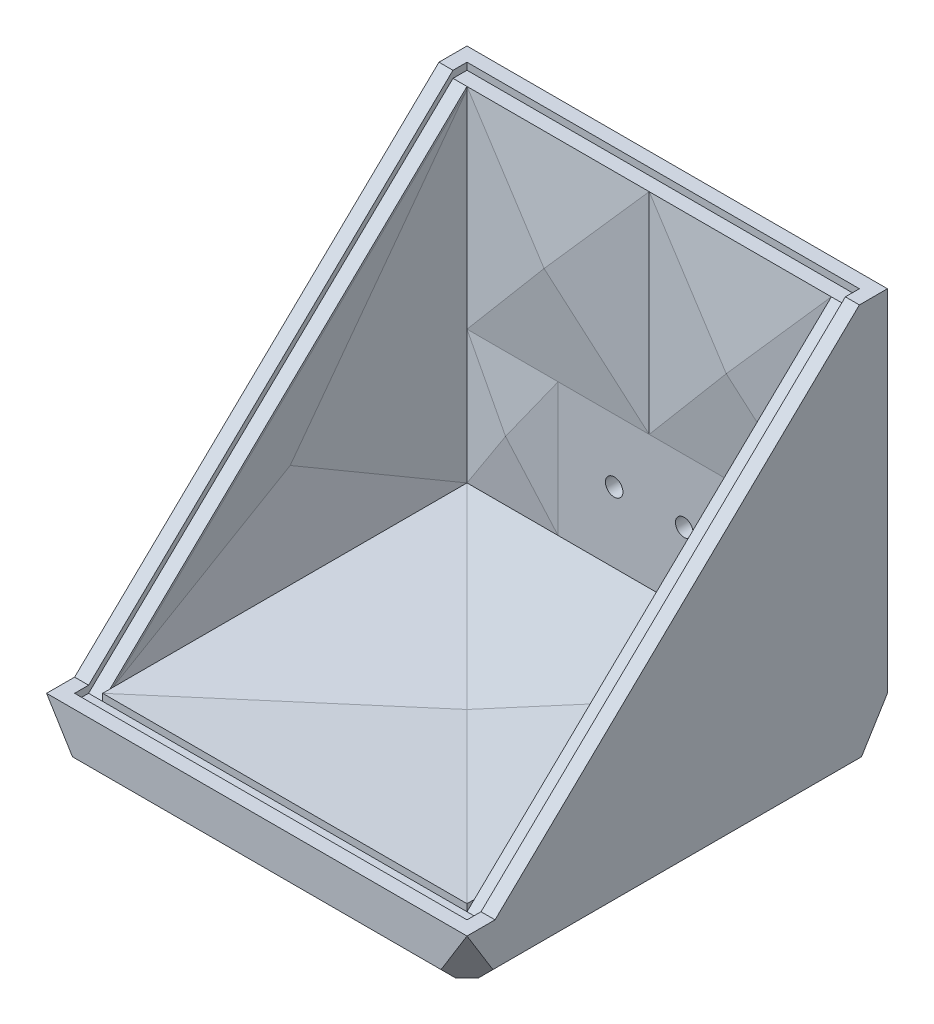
ISO-10303-21;
HEADER;
FILE_DESCRIPTION(('STEP AP214'),'2;1');
FILE_NAME('part.step','',(''),(''),'','','');
FILE_SCHEMA(('AUTOMOTIVE_DESIGN { 1 0 10303 214 1 1 1 1 }'));
ENDSEC;
DATA;
#1=APPLICATION_CONTEXT('core data for automotive mechanical design processes');
#2=APPLICATION_PROTOCOL_DEFINITION('international standard','automotive_design',2000,#1);
#3=PRODUCT_CONTEXT('',#1,'mechanical');
#4=PRODUCT('Part','Part','',(#3));
#5=PRODUCT_RELATED_PRODUCT_CATEGORY('part','',(#4));
#6=PRODUCT_DEFINITION_FORMATION('','',#4);
#7=PRODUCT_DEFINITION_CONTEXT('part definition',#1,'design');
#8=PRODUCT_DEFINITION('design','',#6,#7);
#9=PRODUCT_DEFINITION_SHAPE('','',#8);
#10=(LENGTH_UNIT() NAMED_UNIT(*) SI_UNIT(.MILLI.,.METRE.));
#11=(NAMED_UNIT(*) PLANE_ANGLE_UNIT() SI_UNIT($,.RADIAN.));
#12=(NAMED_UNIT(*) SI_UNIT($,.STERADIAN.) SOLID_ANGLE_UNIT());
#13=UNCERTAINTY_MEASURE_WITH_UNIT(LENGTH_MEASURE(1.E-05),#10,'distance_accuracy_value','');
#14=(GEOMETRIC_REPRESENTATION_CONTEXT(3) GLOBAL_UNCERTAINTY_ASSIGNED_CONTEXT((#13)) GLOBAL_UNIT_ASSIGNED_CONTEXT((#10,
#11,#12)) REPRESENTATION_CONTEXT('',''));
#15=CARTESIAN_POINT('',(0.,0.,0.));
#16=DIRECTION('',(0.,0.,1.));
#17=DIRECTION('',(1.,0.,0.));
#18=AXIS2_PLACEMENT_3D('',#15,#16,#17);
#19=CARTESIAN_POINT('',(66.04,146.05,-142.24));
#20=DIRECTION('',(0.,0.720833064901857,0.693108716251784));
#21=DIRECTION('',(0.,-0.693108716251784,0.720833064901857));
#22=AXIS2_PLACEMENT_3D('',#19,#20,#21);
#23=PLANE('',#22);
#24=DIRECTION('',(1.,0.,0.));
#25=VECTOR('',#24,1.);
#26=CARTESIAN_POINT('',(66.04,146.05,-142.24));
#27=LINE('',#26,#25);
#28=CARTESIAN_POINT('',(71.1200000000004,146.05,-142.24));
#29=VERTEX_POINT('',#28);
#30=CARTESIAN_POINT('',(76.2,146.05,-142.24));
#31=VERTEX_POINT('',#30);
#32=EDGE_CURVE('E313',#29,#31,#27,.T.);
#33=ORIENTED_EDGE('',*,*,#32,.F.);
#34=DIRECTION('',(0.,0.693108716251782,-0.720833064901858));
#35=VECTOR('',#34,1.);
#36=CARTESIAN_POINT('',(71.1200000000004,144.829784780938,-140.970976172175));
#37=LINE('',#36,#35);
#38=CARTESIAN_POINT('',(71.1200000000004,19.0500019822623,-10.1600020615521));
#39=VERTEX_POINT('',#38);
#40=EDGE_CURVE('E297',#39,#29,#37,.T.);
#41=ORIENTED_EDGE('',*,*,#40,.F.);
#42=DIRECTION('',(1.,0.,0.));
#43=VECTOR('',#42,1.);
#44=CARTESIAN_POINT('',(66.04,19.05,-10.16));
#45=LINE('',#44,#43);
#46=CARTESIAN_POINT('',(76.2,19.05,-10.16));
#47=VERTEX_POINT('',#46);
#48=EDGE_CURVE('E322',#39,#47,#45,.T.);
#49=ORIENTED_EDGE('',*,*,#48,.T.);
#50=DIRECTION('',(0.,-0.693108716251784,0.720833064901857));
#51=VECTOR('',#50,1.);
#52=CARTESIAN_POINT('',(76.2,146.05,-142.24));
#53=LINE('',#52,#51);
#54=EDGE_CURVE('E321',#31,#47,#53,.T.);
#55=ORIENTED_EDGE('',*,*,#54,.F.);
#56=EDGE_LOOP('',(#33,#41,#49,#55));
#57=FACE_BOUND('',#56,.T.);
#58=ADVANCED_FACE('F56',(#57),#23,.T.);
#59=CARTESIAN_POINT('',(-71.1200000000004,16.51,-10.1600020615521));
#60=DIRECTION('',(0.,0.,-1.));
#61=DIRECTION('',(-1.,0.,0.));
#62=AXIS2_PLACEMENT_3D('',#59,#60,#61);
#63=PLANE('',#62);
#64=DIRECTION('',(0.,1.,0.));
#65=VECTOR('',#64,1.);
#66=CARTESIAN_POINT('',(66.0400000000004,16.51,-10.1600020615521));
#67=LINE('',#66,#65);
#68=CARTESIAN_POINT('',(66.0400000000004,16.51,-10.1600020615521));
#69=VERTEX_POINT('',#68);
#70=CARTESIAN_POINT('',(66.0400000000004,19.0500019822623,-10.1600020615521));
#71=VERTEX_POINT('',#70);
#72=EDGE_CURVE('E963',#69,#71,#67,.T.);
#73=ORIENTED_EDGE('',*,*,#72,.T.);
#74=DIRECTION('',(-1.,0.,0.));
#75=VECTOR('',#74,1.);
#76=CARTESIAN_POINT('',(-66.0399999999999,19.05,-10.16));
#77=LINE('',#76,#75);
#78=CARTESIAN_POINT('',(-66.0400000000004,19.0500019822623,-10.1600020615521));
#79=VERTEX_POINT('',#78);
#80=EDGE_CURVE('E515',#71,#79,#77,.T.);
#81=ORIENTED_EDGE('',*,*,#80,.T.);
#82=DIRECTION('',(0.,1.,0.));
#83=VECTOR('',#82,1.);
#84=CARTESIAN_POINT('',(-66.0400000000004,16.51,-10.1600020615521));
#85=LINE('',#84,#83);
#86=CARTESIAN_POINT('',(-66.0400000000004,16.51,-10.1600020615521));
#87=VERTEX_POINT('',#86);
#88=EDGE_CURVE('E965',#87,#79,#85,.T.);
#89=ORIENTED_EDGE('',*,*,#88,.F.);
#90=DIRECTION('',(-1.,0.,0.));
#91=VECTOR('',#90,1.);
#92=CARTESIAN_POINT('',(-71.1200000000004,16.51,-10.1600020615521));
#93=LINE('',#92,#91);
#94=EDGE_CURVE('E723',#69,#87,#93,.T.);
#95=ORIENTED_EDGE('',*,*,#94,.F.);
#96=EDGE_LOOP('',(#73,#81,#89,#95));
#97=FACE_BOUND('',#96,.T.);
#98=ADVANCED_FACE('F833',(#97),#63,.F.);
#99=CARTESIAN_POINT('',(-66.0400000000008,145.340915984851,-141.502552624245));
#100=DIRECTION('',(-1.,0.,0.));
#101=DIRECTION('',(0.,0.,1.));
#102=AXIS2_PLACEMENT_3D('',#99,#100,#101);
#103=PLANE('',#102);
#104=DIRECTION('',(0.,-1.,0.));
#105=VECTOR('',#104,1.);
#106=CARTESIAN_POINT('',(-66.04,146.05,-142.24));
#107=LINE('',#106,#105);
#108=CARTESIAN_POINT('',(-66.0400000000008,143.510000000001,-142.24));
#109=VERTEX_POINT('',#108);
#110=CARTESIAN_POINT('',(-66.0400000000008,142.526299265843,-142.240000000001));
#111=VERTEX_POINT('',#110);
#112=EDGE_CURVE('E485',#109,#111,#107,.T.);
#113=ORIENTED_EDGE('',*,*,#112,.F.);
#114=DIRECTION('',(0.,0.693108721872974,-0.720833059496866));
#115=VECTOR('',#114,1.);
#116=CARTESIAN_POINT('',(-66.0400000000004,16.51,-10.1600020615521));
#117=LINE('',#116,#115);
#118=CARTESIAN_POINT('',(-66.0400000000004,19.0499999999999,-12.8016020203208));
#119=VERTEX_POINT('',#118);
#120=EDGE_CURVE('E704',#119,#109,#117,.T.);
#121=ORIENTED_EDGE('',*,*,#120,.F.);
#122=DIRECTION('',(0.,0.,-1.));
#123=VECTOR('',#122,1.);
#124=CARTESIAN_POINT('',(-66.04,19.05,0.));
#125=LINE('',#124,#123);
#126=CARTESIAN_POINT('',(-66.0400000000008,19.05,-13.8246487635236));
#127=VERTEX_POINT('',#126);
#128=EDGE_CURVE('E490',#119,#127,#125,.T.);
#129=ORIENTED_EDGE('',*,*,#128,.T.);
#130=DIRECTION('',(0.,0.693108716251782,-0.720833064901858));
#131=VECTOR('',#130,1.);
#132=CARTESIAN_POINT('',(-66.04,144.219084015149,-144.00049613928));
#133=LINE('',#132,#131);
#134=EDGE_CURVE('E489',#127,#111,#133,.T.);
#135=ORIENTED_EDGE('',*,*,#134,.T.);
#136=EDGE_LOOP('',(#113,#121,#129,#135));
#137=FACE_BOUND('',#136,.T.);
#138=ADVANCED_FACE('F703',(#137),#103,.F.);
#139=CARTESIAN_POINT('',(66.0400000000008,145.340915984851,-141.502552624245));
#140=DIRECTION('',(1.,0.,0.));
#141=DIRECTION('',(0.,0.,-1.));
#142=AXIS2_PLACEMENT_3D('',#139,#140,#141);
#143=PLANE('',#142);
#144=DIRECTION('',(0.,0.,-1.));
#145=VECTOR('',#144,1.);
#146=CARTESIAN_POINT('',(66.04,19.05,-10.16));
#147=LINE('',#146,#145);
#148=CARTESIAN_POINT('',(66.0400000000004,19.05,-12.8016020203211));
#149=VERTEX_POINT('',#148);
#150=CARTESIAN_POINT('',(66.0400000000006,19.05,-13.8246487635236));
#151=VERTEX_POINT('',#150);
#152=EDGE_CURVE('E431',#149,#151,#147,.T.);
#153=ORIENTED_EDGE('',*,*,#152,.F.);
#154=DIRECTION('',(0.,0.693108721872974,-0.720833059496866));
#155=VECTOR('',#154,1.);
#156=CARTESIAN_POINT('',(66.0400000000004,16.51,-10.1600020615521));
#157=LINE('',#156,#155);
#158=CARTESIAN_POINT('',(66.0400000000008,143.510000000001,-142.24));
#159=VERTEX_POINT('',#158);
#160=EDGE_CURVE('E1030',#149,#159,#157,.T.);
#161=ORIENTED_EDGE('',*,*,#160,.T.);
#162=DIRECTION('',(0.,-1.,0.));
#163=VECTOR('',#162,1.);
#164=CARTESIAN_POINT('',(66.0399999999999,146.05,-142.24));
#165=LINE('',#164,#163);
#166=CARTESIAN_POINT('',(66.04,142.526299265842,-142.24));
#167=VERTEX_POINT('',#166);
#168=EDGE_CURVE('E452',#159,#167,#165,.T.);
#169=ORIENTED_EDGE('',*,*,#168,.T.);
#170=DIRECTION('',(0.,-0.693108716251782,0.720833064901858));
#171=VECTOR('',#170,1.);
#172=CARTESIAN_POINT('',(66.04,144.219084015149,-144.00049613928));
#173=LINE('',#172,#171);
#174=EDGE_CURVE('E491',#167,#151,#173,.T.);
#175=ORIENTED_EDGE('',*,*,#174,.T.);
#176=EDGE_LOOP('',(#153,#161,#169,#175));
#177=FACE_BOUND('',#176,.T.);
#178=ADVANCED_FACE('F1028',(#177),#143,.F.);
#179=CARTESIAN_POINT('',(66.0399999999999,146.05,-142.24));
#180=DIRECTION('',(0.,0.,-1.));
#181=DIRECTION('',(-1.,0.,0.));
#182=AXIS2_PLACEMENT_3D('',#179,#180,#181);
#183=PLANE('',#182);
#184=DIRECTION('',(1.,0.,0.));
#185=VECTOR('',#184,1.);
#186=CARTESIAN_POINT('',(66.0399999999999,19.05,-142.24));
#187=LINE('',#186,#185);
#188=CARTESIAN_POINT('',(-33.0200000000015,19.05,-142.24));
#189=VERTEX_POINT('',#188);
#190=CARTESIAN_POINT('',(33.0200000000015,19.05,-142.24));
#191=VERTEX_POINT('',#190);
#192=EDGE_CURVE('E623',#189,#191,#187,.T.);
#193=ORIENTED_EDGE('',*,*,#192,.T.);
#194=DIRECTION('',(0.,1.,0.));
#195=VECTOR('',#194,1.);
#196=CARTESIAN_POINT('',(33.0199999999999,67.31,-142.24));
#197=LINE('',#196,#195);
#198=CARTESIAN_POINT('',(33.0199999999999,67.31,-142.24));
#199=VERTEX_POINT('',#198);
#200=EDGE_CURVE('E634',#191,#199,#197,.T.);
#201=ORIENTED_EDGE('',*,*,#200,.T.);
#202=DIRECTION('',(1.,0.,0.));
#203=VECTOR('',#202,1.);
#204=CARTESIAN_POINT('',(0.,67.31,-142.24));
#205=LINE('',#204,#203);
#206=CARTESIAN_POINT('',(0.,67.31,-142.24));
#207=VERTEX_POINT('',#206);
#208=EDGE_CURVE('E540',#207,#199,#205,.T.);
#209=ORIENTED_EDGE('',*,*,#208,.F.);
#210=DIRECTION('',(-1.,0.,0.));
#211=VECTOR('',#210,1.);
#212=CARTESIAN_POINT('',(0.,67.31,-142.24));
#213=LINE('',#212,#211);
#214=CARTESIAN_POINT('',(-33.0199999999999,67.31,-142.24));
#215=VERTEX_POINT('',#214);
#216=EDGE_CURVE('E80',#207,#215,#213,.T.);
#217=ORIENTED_EDGE('',*,*,#216,.T.);
#218=DIRECTION('',(0.,1.,0.));
#219=VECTOR('',#218,1.);
#220=CARTESIAN_POINT('',(-33.0199999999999,67.31,-142.24));
#221=LINE('',#220,#219);
#222=EDGE_CURVE('E73',#189,#215,#221,.T.);
#223=ORIENTED_EDGE('',*,*,#222,.F.);
#224=EDGE_LOOP('',(#193,#201,#209,#217,#223));
#225=FACE_BOUND('',#224,.T.);
#226=CARTESIAN_POINT('',(12.7,44.45,-142.24));
#227=DIRECTION('',(0.,0.,1.));
#228=DIRECTION('',(1.,0.,0.));
#229=AXIS2_PLACEMENT_3D('',#226,#227,#228);
#230=CIRCLE('',#229,3.175);
#231=CARTESIAN_POINT('',(15.875,44.45,-142.24));
#232=VERTEX_POINT('',#231);
#233=EDGE_CURVE('E749',#232,#232,#230,.T.);
#234=ORIENTED_EDGE('',*,*,#233,.F.);
#235=EDGE_LOOP('',(#234));
#236=FACE_BOUND('',#235,.T.);
#237=CARTESIAN_POINT('',(-12.7,44.45,-142.24));
#238=DIRECTION('',(0.,0.,-1.));
#239=DIRECTION('',(-1.,0.,0.));
#240=AXIS2_PLACEMENT_3D('',#237,#238,#239);
#241=CIRCLE('',#240,3.175);
#242=CARTESIAN_POINT('',(-15.875,44.45,-142.24));
#243=VERTEX_POINT('',#242);
#244=EDGE_CURVE('E741',#243,#243,#241,.T.);
#245=ORIENTED_EDGE('',*,*,#244,.T.);
#246=EDGE_LOOP('',(#245));
#247=FACE_BOUND('',#246,.T.);
#248=ADVANCED_FACE('F790',(#225,#236,#247),#183,.F.);
#249=CARTESIAN_POINT('',(-76.2,19.05,-152.4));
#250=DIRECTION('',(0.,0.,-1.));
#251=DIRECTION('',(-1.,0.,0.));
#252=AXIS2_PLACEMENT_3D('',#249,#250,#251);
#253=PLANE('',#252);
#254=DIRECTION('',(0.,-1.,0.));
#255=VECTOR('',#254,1.);
#256=CARTESIAN_POINT('',(-76.2,19.0499999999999,-152.4));
#257=LINE('',#256,#255);
#258=CARTESIAN_POINT('',(-76.2,146.05,-152.4));
#259=VERTEX_POINT('',#258);
#260=CARTESIAN_POINT('',(-76.2,19.0499999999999,-152.4));
#261=VERTEX_POINT('',#260);
#262=EDGE_CURVE('E612',#259,#261,#257,.T.);
#263=ORIENTED_EDGE('',*,*,#262,.F.);
#264=DIRECTION('',(1.,0.,0.));
#265=VECTOR('',#264,1.);
#266=CARTESIAN_POINT('',(66.04,146.05,-152.4));
#267=LINE('',#266,#265);
#268=CARTESIAN_POINT('',(76.2,146.05,-152.4));
#269=VERTEX_POINT('',#268);
#270=EDGE_CURVE('E323',#259,#269,#267,.T.);
#271=ORIENTED_EDGE('',*,*,#270,.T.);
#272=DIRECTION('',(0.,1.,0.));
#273=VECTOR('',#272,1.);
#274=CARTESIAN_POINT('',(76.2,19.05,-152.4));
#275=LINE('',#274,#273);
#276=CARTESIAN_POINT('',(76.2,19.05,-152.4));
#277=VERTEX_POINT('',#276);
#278=EDGE_CURVE('E913',#277,#269,#275,.T.);
#279=ORIENTED_EDGE('',*,*,#278,.F.);
#280=DIRECTION('',(-0.524888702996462,-0.851170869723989,0.));
#281=VECTOR('',#280,1.);
#282=CARTESIAN_POINT('',(66.8019999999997,3.80999999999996,-152.4));
#283=LINE('',#282,#281);
#284=CARTESIAN_POINT('',(66.8019999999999,3.81000000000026,-152.4));
#285=VERTEX_POINT('',#284);
#286=EDGE_CURVE('E363',#277,#285,#283,.T.);
#287=ORIENTED_EDGE('',*,*,#286,.T.);
#288=DIRECTION('',(-1.,0.,0.));
#289=VECTOR('',#288,1.);
#290=CARTESIAN_POINT('',(-76.2,3.81000000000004,-152.4));
#291=LINE('',#290,#289);
#292=CARTESIAN_POINT('',(-66.802,3.81,-152.4));
#293=VERTEX_POINT('',#292);
#294=EDGE_CURVE('E410',#285,#293,#291,.T.);
#295=ORIENTED_EDGE('',*,*,#294,.T.);
#296=DIRECTION('',(0.524888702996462,-0.851170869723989,0.));
#297=VECTOR('',#296,1.);
#298=CARTESIAN_POINT('',(-66.802,3.80999999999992,-152.4));
#299=LINE('',#298,#297);
#300=EDGE_CURVE('E347',#261,#293,#299,.T.);
#301=ORIENTED_EDGE('',*,*,#300,.F.);
#302=EDGE_LOOP('',(#263,#271,#279,#287,#295,#301));
#303=FACE_BOUND('',#302,.T.);
#304=CARTESIAN_POINT('',(12.7,44.45,-152.4));
#305=DIRECTION('',(0.,0.,-1.));
#306=DIRECTION('',(-1.,0.,0.));
#307=AXIS2_PLACEMENT_3D('',#304,#305,#306);
#308=CIRCLE('',#307,3.175);
#309=CARTESIAN_POINT('',(9.52499999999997,44.45,-152.4));
#310=VERTEX_POINT('',#309);
#311=EDGE_CURVE('E752',#310,#310,#308,.F.);
#312=ORIENTED_EDGE('',*,*,#311,.T.);
#313=EDGE_LOOP('',(#312));
#314=FACE_BOUND('',#313,.T.);
#315=CARTESIAN_POINT('',(-12.7,44.45,-152.4));
#316=DIRECTION('',(0.,0.,-1.));
#317=DIRECTION('',(-1.,0.,0.));
#318=AXIS2_PLACEMENT_3D('',#315,#316,#317);
#319=CIRCLE('',#318,3.175);
#320=CARTESIAN_POINT('',(-15.875,44.45,-152.4));
#321=VERTEX_POINT('',#320);
#322=EDGE_CURVE('E746',#321,#321,#319,.T.);
#323=ORIENTED_EDGE('',*,*,#322,.F.);
#324=EDGE_LOOP('',(#323));
#325=FACE_BOUND('',#324,.T.);
#326=ADVANCED_FACE('F877',(#303,#314,#325),#253,.T.);
#327=CARTESIAN_POINT('',(-66.0399999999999,142.526299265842,-142.24));
#328=DIRECTION('',(0.,0.571700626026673,0.820462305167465));
#329=DIRECTION('',(0.,-0.820462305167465,0.571700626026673));
#330=AXIS2_PLACEMENT_3D('',#327,#328,#329);
#331=PLANE('',#330);
#332=DIRECTION('',(0.0229297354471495,0.820246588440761,-0.571550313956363));
#333=VECTOR('',#332,1.);
#334=CARTESIAN_POINT('',(-66.0400000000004,142.526299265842,-142.24));
#335=LINE('',#334,#333);
#336=CARTESIAN_POINT('',(-68.5125103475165,54.0792178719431,-80.6098050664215));
#337=VERTEX_POINT('',#336);
#338=EDGE_CURVE('E680',#337,#111,#335,.T.);
#339=ORIENTED_EDGE('',*,*,#338,.F.);
#340=DIRECTION('',(1.,0.,0.));
#341=VECTOR('',#340,1.);
#342=CARTESIAN_POINT('',(-68.58,54.0792178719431,-80.6098050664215));
#343=LINE('',#342,#341);
#344=CARTESIAN_POINT('',(-68.58,54.0792178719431,-80.6098050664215));
#345=VERTEX_POINT('',#344);
#346=EDGE_CURVE('E583',#345,#337,#343,.T.);
#347=ORIENTED_EDGE('',*,*,#346,.F.);
#348=DIRECTION('',(-0.023555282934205,-0.82023465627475,0.571541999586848));
#349=VECTOR('',#348,1.);
#350=CARTESIAN_POINT('',(-66.0399999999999,142.526299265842,-142.24));
#351=LINE('',#350,#349);
#352=EDGE_CURVE('E587',#111,#345,#351,.T.);
#353=ORIENTED_EDGE('',*,*,#352,.F.);
#354=EDGE_LOOP('',(#339,#347,#353));
#355=FACE_BOUND('',#354,.T.);
#356=ADVANCED_FACE('F694',(#355),#331,.F.);
#357=CARTESIAN_POINT('',(-66.0400000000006,19.05,-13.8246487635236));
#358=DIRECTION('',(0.,-0.885577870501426,-0.464490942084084));
#359=DIRECTION('',(0.,0.464490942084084,-0.885577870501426));
#360=AXIS2_PLACEMENT_3D('',#357,#358,#359);
#361=PLANE('',#360);
#362=ORIENTED_EDGE('',*,*,#346,.T.);
#363=DIRECTION('',(0.0327681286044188,-0.464241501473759,0.885102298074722));
#364=VECTOR('',#363,1.);
#365=CARTESIAN_POINT('',(-66.0400000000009,19.05,-13.8246487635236));
#366=LINE('',#365,#364);
#367=EDGE_CURVE('E12',#337,#127,#366,.T.);
#368=ORIENTED_EDGE('',*,*,#367,.T.);
#369=DIRECTION('',(-0.0336615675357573,0.464227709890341,-0.885076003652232));
#370=VECTOR('',#369,1.);
#371=CARTESIAN_POINT('',(-66.0400000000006,19.05,-13.8246487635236));
#372=LINE('',#371,#370);
#373=EDGE_CURVE('E588',#127,#345,#372,.T.);
#374=ORIENTED_EDGE('',*,*,#373,.T.);
#375=EDGE_LOOP('',(#362,#368,#374));
#376=FACE_BOUND('',#375,.T.);
#377=ADVANCED_FACE('F691',(#376),#361,.T.);
#378=CARTESIAN_POINT('',(-76.2,19.05,0.));
#379=DIRECTION('',(0.,1.,0.));
#380=DIRECTION('',(0.,0.,1.));
#381=AXIS2_PLACEMENT_3D('',#378,#379,#380);
#382=PLANE('',#381);
#383=DIRECTION('',(0.,0.,1.));
#384=VECTOR('',#383,1.);
#385=CARTESIAN_POINT('',(-71.1200000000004,19.05,-10.1600020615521));
#386=LINE('',#385,#384);
#387=CARTESIAN_POINT('',(-71.1200000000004,19.0500019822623,-10.1600020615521));
#388=VERTEX_POINT('',#387);
#389=CARTESIAN_POINT('',(-71.1200000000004,19.05,-5.08000206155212));
#390=VERTEX_POINT('',#389);
#391=EDGE_CURVE('E730',#388,#390,#386,.T.);
#392=ORIENTED_EDGE('',*,*,#391,.F.);
#393=DIRECTION('',(-1.,0.,0.));
#394=VECTOR('',#393,1.);
#395=CARTESIAN_POINT('',(-66.04,19.05,-10.1599999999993));
#396=LINE('',#395,#394);
#397=CARTESIAN_POINT('',(-76.2,19.05,-10.1599999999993));
#398=VERTEX_POINT('',#397);
#399=EDGE_CURVE('E611',#388,#398,#396,.T.);
#400=ORIENTED_EDGE('',*,*,#399,.T.);
#401=DIRECTION('',(0.,0.,1.));
#402=VECTOR('',#401,1.);
#403=CARTESIAN_POINT('',(-76.2,19.05,0.));
#404=LINE('',#403,#402);
#405=CARTESIAN_POINT('',(-76.1999999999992,19.05,8.04911692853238E-13));
#406=VERTEX_POINT('',#405);
#407=EDGE_CURVE('E418',#398,#406,#404,.T.);
#408=ORIENTED_EDGE('',*,*,#407,.T.);
#409=DIRECTION('',(1.,0.,0.));
#410=VECTOR('',#409,1.);
#411=CARTESIAN_POINT('',(-76.2,19.05,0.));
#412=LINE('',#411,#410);
#413=CARTESIAN_POINT('',(76.2,19.05,0.));
#414=VERTEX_POINT('',#413);
#415=EDGE_CURVE('E395',#406,#414,#412,.T.);
#416=ORIENTED_EDGE('',*,*,#415,.T.);
#417=DIRECTION('',(0.,0.,1.));
#418=VECTOR('',#417,1.);
#419=CARTESIAN_POINT('',(76.2,19.05,0.));
#420=LINE('',#419,#418);
#421=EDGE_CURVE('E391',#47,#414,#420,.T.);
#422=ORIENTED_EDGE('',*,*,#421,.F.);
#423=ORIENTED_EDGE('',*,*,#48,.F.);
#424=DIRECTION('',(0.,0.,-1.));
#425=VECTOR('',#424,1.);
#426=CARTESIAN_POINT('',(71.1199999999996,19.05,-10.1600020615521));
#427=LINE('',#426,#425);
#428=CARTESIAN_POINT('',(71.1199999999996,19.05,-5.08000206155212));
#429=VERTEX_POINT('',#428);
#430=EDGE_CURVE('E303',#429,#39,#427,.T.);
#431=ORIENTED_EDGE('',*,*,#430,.F.);
#432=DIRECTION('',(1.,0.,0.));
#433=VECTOR('',#432,1.);
#434=CARTESIAN_POINT('',(-71.1200000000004,19.05,-5.08000206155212));
#435=LINE('',#434,#433);
#436=EDGE_CURVE('E734',#390,#429,#435,.T.);
#437=ORIENTED_EDGE('',*,*,#436,.F.);
#438=EDGE_LOOP('',(#392,#400,#408,#416,#422,#423,#431,#437));
#439=FACE_BOUND('',#438,.T.);
#440=ADVANCED_FACE('F873',(#439),#382,.T.);
#441=CARTESIAN_POINT('',(-76.2,0.,0.));
#442=DIRECTION('',(0.,-1.,0.));
#443=DIRECTION('',(0.,0.,-1.));
#444=AXIS2_PLACEMENT_3D('',#441,#442,#443);
#445=PLANE('',#444);
#446=DIRECTION('',(-1.,0.,0.));
#447=VECTOR('',#446,1.);
#448=CARTESIAN_POINT('',(-76.2,0.,-3.81000000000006));
#449=LINE('',#448,#447);
#450=CARTESIAN_POINT('',(68.2625000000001,0.,-3.81000000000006));
#451=VERTEX_POINT('',#450);
#452=CARTESIAN_POINT('',(-68.2624999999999,0.,-3.81000000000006));
#453=VERTEX_POINT('',#452);
#454=EDGE_CURVE('E401',#451,#453,#449,.T.);
#455=ORIENTED_EDGE('',*,*,#454,.T.);
#456=DIRECTION('',(-0.707106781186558,0.,-0.707106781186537));
#457=VECTOR('',#456,1.);
#458=CARTESIAN_POINT('',(-70.32625,0.,-5.87375000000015));
#459=LINE('',#458,#457);
#460=CARTESIAN_POINT('',(-72.3899999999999,0.,-7.93749999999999));
#461=VERTEX_POINT('',#460);
#462=EDGE_CURVE('E336',#453,#461,#459,.T.);
#463=ORIENTED_EDGE('',*,*,#462,.T.);
#464=DIRECTION('',(0.,0.,-1.));
#465=VECTOR('',#464,1.);
#466=CARTESIAN_POINT('',(-72.3899999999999,0.,0.));
#467=LINE('',#466,#465);
#468=CARTESIAN_POINT('',(-72.3899999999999,0.,-144.4625));
#469=VERTEX_POINT('',#468);
#470=EDGE_CURVE('E399',#461,#469,#467,.T.);
#471=ORIENTED_EDGE('',*,*,#470,.T.);
#472=DIRECTION('',(0.707106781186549,0.,-0.707106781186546));
#473=VECTOR('',#472,1.);
#474=CARTESIAN_POINT('',(-146.52625,0.,-70.3262500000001));
#475=LINE('',#474,#473);
#476=CARTESIAN_POINT('',(-68.2624999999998,0.,-148.59));
#477=VERTEX_POINT('',#476);
#478=EDGE_CURVE('E351',#469,#477,#475,.T.);
#479=ORIENTED_EDGE('',*,*,#478,.T.);
#480=DIRECTION('',(1.,0.,0.));
#481=VECTOR('',#480,1.);
#482=CARTESIAN_POINT('',(-76.2,0.,-148.59));
#483=LINE('',#482,#481);
#484=CARTESIAN_POINT('',(68.2625000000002,0.,-148.59));
#485=VERTEX_POINT('',#484);
#486=EDGE_CURVE('E394',#477,#485,#483,.T.);
#487=ORIENTED_EDGE('',*,*,#486,.T.);
#488=DIRECTION('',(-0.707106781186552,0.,-0.707106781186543));
#489=VECTOR('',#488,1.);
#490=CARTESIAN_POINT('',(70.3262499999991,0.,-146.526250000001));
#491=LINE('',#490,#489);
#492=CARTESIAN_POINT('',(72.39,0.,-144.4625));
#493=VERTEX_POINT('',#492);
#494=EDGE_CURVE('E366',#493,#485,#491,.T.);
#495=ORIENTED_EDGE('',*,*,#494,.F.);
#496=DIRECTION('',(0.,0.,1.));
#497=VECTOR('',#496,1.);
#498=CARTESIAN_POINT('',(72.3899999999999,0.,0.));
#499=LINE('',#498,#497);
#500=CARTESIAN_POINT('',(72.3899999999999,0.,-7.93749999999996));
#501=VERTEX_POINT('',#500);
#502=EDGE_CURVE('E397',#493,#501,#499,.T.);
#503=ORIENTED_EDGE('',*,*,#502,.T.);
#504=DIRECTION('',(0.707106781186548,0.,-0.707106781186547));
#505=VECTOR('',#504,1.);
#506=CARTESIAN_POINT('',(-5.87375000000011,0.,70.32625));
#507=LINE('',#506,#505);
#508=EDGE_CURVE('E380',#451,#501,#507,.T.);
#509=ORIENTED_EDGE('',*,*,#508,.F.);
#510=EDGE_LOOP('',(#455,#463,#471,#479,#487,#495,#503,#509));
#511=FACE_BOUND('',#510,.T.);
#512=ADVANCED_FACE('F867',(#511),#445,.T.);
#513=CARTESIAN_POINT('',(-76.2,0.,0.));
#514=DIRECTION('',(-1.,0.,0.));
#515=DIRECTION('',(0.,0.,1.));
#516=AXIS2_PLACEMENT_3D('',#513,#514,#515);
#517=PLANE('',#516);
#518=DIRECTION('',(0.,0.,1.));
#519=VECTOR('',#518,1.);
#520=CARTESIAN_POINT('',(-76.2,3.81000000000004,0.));
#521=LINE('',#520,#519);
#522=CARTESIAN_POINT('',(-76.2,3.81000000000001,-143.002));
#523=VERTEX_POINT('',#522);
#524=CARTESIAN_POINT('',(-76.1999999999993,3.80999999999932,-9.39799999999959));
#525=VERTEX_POINT('',#524);
#526=EDGE_CURVE('E404',#523,#525,#521,.T.);
#527=ORIENTED_EDGE('',*,*,#526,.T.);
#528=DIRECTION('',(0.,-0.851170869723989,-0.524888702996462));
#529=VECTOR('',#528,1.);
#530=CARTESIAN_POINT('',(-76.1999999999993,3.80999999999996,-9.3979999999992));
#531=LINE('',#530,#529);
#532=EDGE_CURVE('E325',#406,#525,#531,.T.);
#533=ORIENTED_EDGE('',*,*,#532,.F.);
#534=ORIENTED_EDGE('',*,*,#407,.F.);
#535=DIRECTION('',(0.,0.693108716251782,-0.720833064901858));
#536=VECTOR('',#535,1.);
#537=CARTESIAN_POINT('',(-76.2,146.05,-142.24));
#538=LINE('',#537,#536);
#539=CARTESIAN_POINT('',(-76.2,146.05,-142.24));
#540=VERTEX_POINT('',#539);
#541=EDGE_CURVE('E488',#398,#540,#538,.T.);
#542=ORIENTED_EDGE('',*,*,#541,.T.);
#543=DIRECTION('',(0.,0.,-1.));
#544=VECTOR('',#543,1.);
#545=CARTESIAN_POINT('',(-76.2,146.05,-152.4));
#546=LINE('',#545,#544);
#547=EDGE_CURVE('E927',#540,#259,#546,.T.);
#548=ORIENTED_EDGE('',*,*,#547,.T.);
#549=ORIENTED_EDGE('',*,*,#262,.T.);
#550=DIRECTION('',(0.,-0.851170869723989,0.524888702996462));
#551=VECTOR('',#550,1.);
#552=CARTESIAN_POINT('',(-76.2,3.80999999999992,-143.002));
#553=LINE('',#552,#551);
#554=EDGE_CURVE('E348',#261,#523,#553,.T.);
#555=ORIENTED_EDGE('',*,*,#554,.T.);
#556=EDGE_LOOP('',(#527,#533,#534,#542,#548,#549,#555));
#557=FACE_BOUND('',#556,.T.);
#558=ADVANCED_FACE('F863',(#557),#517,.T.);
#559=CARTESIAN_POINT('',(-72.3899999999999,0.,0.));
#560=DIRECTION('',(0.707106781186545,0.70710678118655,0.));
#561=DIRECTION('',(0.,0.,-1.));
#562=AXIS2_PLACEMENT_3D('',#559,#560,#561);
#563=PLANE('',#562);
#564=ORIENTED_EDGE('',*,*,#470,.F.);
#565=DIRECTION('',(0.682479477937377,-0.682479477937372,0.261617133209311));
#566=VECTOR('',#565,1.);
#567=CARTESIAN_POINT('',(-70.9727726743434,-1.41722732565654,-7.39422952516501));
#568=LINE('',#567,#566);
#569=EDGE_CURVE('E344',#461,#525,#568,.F.);
#570=ORIENTED_EDGE('',*,*,#569,.T.);
#571=ORIENTED_EDGE('',*,*,#526,.F.);
#572=DIRECTION('',(-0.682479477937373,0.682479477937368,0.261617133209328));
#573=VECTOR('',#572,1.);
#574=CARTESIAN_POINT('',(-98.1835373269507,25.7935373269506,-134.574977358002));
#575=LINE('',#574,#573);
#576=EDGE_CURVE('E901',#523,#469,#575,.F.);
#577=ORIENTED_EDGE('',*,*,#576,.T.);
#578=EDGE_LOOP('',(#564,#570,#571,#577));
#579=FACE_BOUND('',#578,.T.);
#580=ADVANCED_FACE('F866',(#579),#563,.F.);
#581=CARTESIAN_POINT('',(-76.2,0.,0.));
#582=DIRECTION('',(0.,0.,1.));
#583=DIRECTION('',(1.,0.,0.));
#584=AXIS2_PLACEMENT_3D('',#581,#582,#583);
#585=PLANE('',#584);
#586=ORIENTED_EDGE('',*,*,#415,.F.);
#587=DIRECTION('',(0.524888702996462,-0.851170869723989,0.));
#588=VECTOR('',#587,1.);
#589=CARTESIAN_POINT('',(-66.8019999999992,3.80999999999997,7.07767178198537E-13));
#590=LINE('',#589,#588);
#591=CARTESIAN_POINT('',(-66.8019999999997,3.81000000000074,7.08851380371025E-13));
#592=VERTEX_POINT('',#591);
#593=EDGE_CURVE('E333',#406,#592,#590,.T.);
#594=ORIENTED_EDGE('',*,*,#593,.T.);
#595=DIRECTION('',(1.,0.,0.));
#596=VECTOR('',#595,1.);
#597=CARTESIAN_POINT('',(-76.2,3.81000000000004,0.));
#598=LINE('',#597,#596);
#599=CARTESIAN_POINT('',(66.802,3.81000000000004,0.));
#600=VERTEX_POINT('',#599);
#601=EDGE_CURVE('E392',#592,#600,#598,.T.);
#602=ORIENTED_EDGE('',*,*,#601,.T.);
#603=DIRECTION('',(-0.524888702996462,-0.851170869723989,0.));
#604=VECTOR('',#603,1.);
#605=CARTESIAN_POINT('',(66.802,3.81000000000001,0.));
#606=LINE('',#605,#604);
#607=EDGE_CURVE('E376',#414,#600,#606,.T.);
#608=ORIENTED_EDGE('',*,*,#607,.F.);
#609=EDGE_LOOP('',(#586,#594,#602,#608));
#610=FACE_BOUND('',#609,.T.);
#611=ADVANCED_FACE('F884',(#610),#585,.T.);
#612=CARTESIAN_POINT('',(-76.2,3.81000000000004,0.));
#613=DIRECTION('',(0.,0.70710678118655,-0.707106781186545));
#614=DIRECTION('',(1.,0.,0.));
#615=AXIS2_PLACEMENT_3D('',#612,#613,#614);
#616=PLANE('',#615);
#617=ORIENTED_EDGE('',*,*,#601,.F.);
#618=DIRECTION('',(0.261617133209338,0.682479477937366,0.682479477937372));
#619=VECTOR('',#618,1.);
#620=CARTESIAN_POINT('',(-67.4452322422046,2.13200284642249,-1.67799715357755));
#621=LINE('',#620,#619);
#622=EDGE_CURVE('E427',#592,#453,#621,.F.);
#623=ORIENTED_EDGE('',*,*,#622,.T.);
#624=ORIENTED_EDGE('',*,*,#454,.F.);
#625=DIRECTION('',(-0.261617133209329,0.682479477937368,0.682479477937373));
#626=VECTOR('',#625,1.);
#627=CARTESIAN_POINT('',(57.0144391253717,29.3427674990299,25.5327674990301));
#628=LINE('',#627,#626);
#629=EDGE_CURVE('E413',#600,#451,#628,.F.);
#630=ORIENTED_EDGE('',*,*,#629,.F.);
#631=EDGE_LOOP('',(#617,#623,#624,#630));
#632=FACE_BOUND('',#631,.T.);
#633=ADVANCED_FACE('F887',(#632),#616,.F.);
#634=CARTESIAN_POINT('',(-76.2,0.,-148.59));
#635=DIRECTION('',(0.,0.70710678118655,0.707106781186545));
#636=DIRECTION('',(1.,0.,0.));
#637=AXIS2_PLACEMENT_3D('',#634,#635,#636);
#638=PLANE('',#637);
#639=ORIENTED_EDGE('',*,*,#486,.F.);
#640=DIRECTION('',(-0.261617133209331,-0.682479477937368,0.682479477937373));
#641=VECTOR('',#640,1.);
#642=CARTESIAN_POINT('',(-68.8057704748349,-1.41722732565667,-147.172772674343));
#643=LINE('',#642,#641);
#644=EDGE_CURVE('E359',#477,#293,#643,.F.);
#645=ORIENTED_EDGE('',*,*,#644,.T.);
#646=ORIENTED_EDGE('',*,*,#294,.F.);
#647=DIRECTION('',(0.261617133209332,-0.682479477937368,0.682479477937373));
#648=VECTOR('',#647,1.);
#649=CARTESIAN_POINT('',(58.374977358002,25.793537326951,-174.383537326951));
#650=LINE('',#649,#648);
#651=EDGE_CURVE('E374',#485,#285,#650,.F.);
#652=ORIENTED_EDGE('',*,*,#651,.F.);
#653=EDGE_LOOP('',(#639,#645,#646,#652));
#654=FACE_BOUND('',#653,.T.);
#655=ADVANCED_FACE('F58',(#654),#638,.F.);
#656=CARTESIAN_POINT('',(76.2,0.,0.));
#657=DIRECTION('',(-1.,0.,0.));
#658=DIRECTION('',(0.,0.,1.));
#659=AXIS2_PLACEMENT_3D('',#656,#657,#658);
#660=PLANE('',#659);
#661=DIRECTION('',(0.,0.,-1.));
#662=VECTOR('',#661,1.);
#663=CARTESIAN_POINT('',(76.2,3.81000000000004,-152.4));
#664=LINE('',#663,#662);
#665=CARTESIAN_POINT('',(76.2,3.81000000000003,-9.39799999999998));
#666=VERTEX_POINT('',#665);
#667=CARTESIAN_POINT('',(76.2,3.81000000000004,-143.002));
#668=VERTEX_POINT('',#667);
#669=EDGE_CURVE('E407',#666,#668,#664,.T.);
#670=ORIENTED_EDGE('',*,*,#669,.T.);
#671=DIRECTION('',(0.,-0.851170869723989,0.524888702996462));
#672=VECTOR('',#671,1.);
#673=CARTESIAN_POINT('',(76.1999999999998,3.80999999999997,-143.002));
#674=LINE('',#673,#672);
#675=EDGE_CURVE('E362',#277,#668,#674,.T.);
#676=ORIENTED_EDGE('',*,*,#675,.F.);
#677=ORIENTED_EDGE('',*,*,#278,.T.);
#678=DIRECTION('',(0.,0.,1.));
#679=VECTOR('',#678,1.);
#680=CARTESIAN_POINT('',(76.2,146.05,-152.4));
#681=LINE('',#680,#679);
#682=EDGE_CURVE('E330',#269,#31,#681,.T.);
#683=ORIENTED_EDGE('',*,*,#682,.T.);
#684=ORIENTED_EDGE('',*,*,#54,.T.);
#685=ORIENTED_EDGE('',*,*,#421,.T.);
#686=DIRECTION('',(0.,-0.851170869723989,-0.524888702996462));
#687=VECTOR('',#686,1.);
#688=CARTESIAN_POINT('',(76.2,3.81000000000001,-9.398));
#689=LINE('',#688,#687);
#690=EDGE_CURVE('E377',#414,#666,#689,.T.);
#691=ORIENTED_EDGE('',*,*,#690,.T.);
#692=EDGE_LOOP('',(#670,#676,#677,#683,#684,#685,#691));
#693=FACE_BOUND('',#692,.T.);
#694=ADVANCED_FACE('F869',(#693),#660,.F.);
#695=CARTESIAN_POINT('',(76.2,3.81000000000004,0.));
#696=DIRECTION('',(0.707106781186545,-0.70710678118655,0.));
#697=DIRECTION('',(0.,0.,1.));
#698=AXIS2_PLACEMENT_3D('',#695,#696,#697);
#699=PLANE('',#698);
#700=DIRECTION('',(-0.682479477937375,-0.68247947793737,-0.26161713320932));
#701=VECTOR('',#700,1.);
#702=CARTESIAN_POINT('',(101.732767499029,29.3427674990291,-133.214439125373));
#703=LINE('',#702,#701);
#704=EDGE_CURVE('E415',#668,#493,#703,.T.);
#705=ORIENTED_EDGE('',*,*,#704,.F.);
#706=ORIENTED_EDGE('',*,*,#669,.F.);
#707=DIRECTION('',(0.682479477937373,0.682479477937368,-0.261617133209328));
#708=VECTOR('',#707,1.);
#709=CARTESIAN_POINT('',(74.5220028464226,2.13200284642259,-8.7547677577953));
#710=LINE('',#709,#708);
#711=EDGE_CURVE('E389',#501,#666,#710,.T.);
#712=ORIENTED_EDGE('',*,*,#711,.F.);
#713=ORIENTED_EDGE('',*,*,#502,.F.);
#714=EDGE_LOOP('',(#705,#706,#712,#713));
#715=FACE_BOUND('',#714,.T.);
#716=ADVANCED_FACE('F861',(#715),#699,.T.);
#717=CARTESIAN_POINT('',(27.0777220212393,-16.6979285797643,27.0777220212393));
#718=DIRECTION('',(-0.64816589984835,0.399702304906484,-0.648165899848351));
#719=DIRECTION('',(-0.707106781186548,0.,0.707106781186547));
#720=AXIS2_PLACEMENT_3D('',#717,#718,#719);
#721=PLANE('',#720);
#722=ORIENTED_EDGE('',*,*,#711,.T.);
#723=ORIENTED_EDGE('',*,*,#690,.F.);
#724=ORIENTED_EDGE('',*,*,#607,.T.);
#725=ORIENTED_EDGE('',*,*,#629,.T.);
#726=ORIENTED_EDGE('',*,*,#508,.T.);
#727=EDGE_LOOP('',(#722,#723,#724,#725,#726));
#728=FACE_BOUND('',#727,.T.);
#729=ADVANCED_FACE('F857',(#728),#721,.F.);
#730=CARTESIAN_POINT('',(91.1038627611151,-56.1807153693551,-91.1038627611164));
#731=DIRECTION('',(-0.648165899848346,0.399702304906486,0.648165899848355));
#732=DIRECTION('',(0.707106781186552,0.,0.707106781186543));
#733=AXIS2_PLACEMENT_3D('',#730,#731,#732);
#734=PLANE('',#733);
#735=ORIENTED_EDGE('',*,*,#651,.T.);
#736=ORIENTED_EDGE('',*,*,#286,.F.);
#737=ORIENTED_EDGE('',*,*,#675,.T.);
#738=ORIENTED_EDGE('',*,*,#704,.T.);
#739=ORIENTED_EDGE('',*,*,#494,.T.);
#740=EDGE_LOOP('',(#735,#736,#737,#738,#739));
#741=FACE_BOUND('',#740,.T.);
#742=ADVANCED_FACE('F853',(#741),#734,.F.);
#743=CARTESIAN_POINT('',(-91.1038627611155,-56.1807153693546,-91.1038627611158));
#744=DIRECTION('',(-0.64816589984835,-0.399702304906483,-0.648165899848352));
#745=DIRECTION('',(-0.707106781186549,0.,0.707106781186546));
#746=AXIS2_PLACEMENT_3D('',#743,#744,#745);
#747=PLANE('',#746);
#748=ORIENTED_EDGE('',*,*,#478,.F.);
#749=ORIENTED_EDGE('',*,*,#576,.F.);
#750=ORIENTED_EDGE('',*,*,#554,.F.);
#751=ORIENTED_EDGE('',*,*,#300,.T.);
#752=ORIENTED_EDGE('',*,*,#644,.F.);
#753=EDGE_LOOP('',(#748,#749,#750,#751,#752));
#754=FACE_BOUND('',#753,.T.);
#755=ADVANCED_FACE('F849',(#754),#747,.T.);
#756=CARTESIAN_POINT('',(-27.0777220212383,-16.6979285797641,27.0777220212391));
#757=DIRECTION('',(-0.64816589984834,-0.399702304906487,0.64816589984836));
#758=DIRECTION('',(0.707106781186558,0.,0.707106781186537));
#759=AXIS2_PLACEMENT_3D('',#756,#757,#758);
#760=PLANE('',#759);
#761=ORIENTED_EDGE('',*,*,#462,.F.);
#762=ORIENTED_EDGE('',*,*,#622,.F.);
#763=ORIENTED_EDGE('',*,*,#593,.F.);
#764=ORIENTED_EDGE('',*,*,#532,.T.);
#765=ORIENTED_EDGE('',*,*,#569,.F.);
#766=EDGE_LOOP('',(#761,#762,#763,#764,#765));
#767=FACE_BOUND('',#766,.T.);
#768=ADVANCED_FACE('F846',(#767),#760,.T.);
#769=CARTESIAN_POINT('',(66.04,146.05,-152.4));
#770=DIRECTION('',(0.,1.,0.));
#771=DIRECTION('',(0.,0.,1.));
#772=AXIS2_PLACEMENT_3D('',#769,#770,#771);
#773=PLANE('',#772);
#774=DIRECTION('',(0.,0.,1.));
#775=VECTOR('',#774,1.);
#776=CARTESIAN_POINT('',(-71.1200000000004,146.05,-142.24));
#777=LINE('',#776,#775);
#778=CARTESIAN_POINT('',(-71.1200000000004,146.05,-147.32));
#779=VERTEX_POINT('',#778);
#780=CARTESIAN_POINT('',(-71.1200000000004,146.05,-142.24));
#781=VERTEX_POINT('',#780);
#782=EDGE_CURVE('E317',#779,#781,#777,.T.);
#783=ORIENTED_EDGE('',*,*,#782,.F.);
#784=DIRECTION('',(-1.,0.,0.));
#785=VECTOR('',#784,1.);
#786=CARTESIAN_POINT('',(-71.1200000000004,146.05,-147.32));
#787=LINE('',#786,#785);
#788=CARTESIAN_POINT('',(71.1199999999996,146.05,-147.32));
#789=VERTEX_POINT('',#788);
#790=EDGE_CURVE('E316',#789,#779,#787,.T.);
#791=ORIENTED_EDGE('',*,*,#790,.F.);
#792=DIRECTION('',(0.,0.,-1.));
#793=VECTOR('',#792,1.);
#794=CARTESIAN_POINT('',(71.1199999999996,146.05,-142.24));
#795=LINE('',#794,#793);
#796=EDGE_CURVE('E300',#29,#789,#795,.T.);
#797=ORIENTED_EDGE('',*,*,#796,.F.);
#798=ORIENTED_EDGE('',*,*,#32,.T.);
#799=ORIENTED_EDGE('',*,*,#682,.F.);
#800=ORIENTED_EDGE('',*,*,#270,.F.);
#801=ORIENTED_EDGE('',*,*,#547,.F.);
#802=DIRECTION('',(-1.,0.,0.));
#803=VECTOR('',#802,1.);
#804=CARTESIAN_POINT('',(-66.04,146.05,-142.24));
#805=LINE('',#804,#803);
#806=EDGE_CURVE('E436',#781,#540,#805,.T.);
#807=ORIENTED_EDGE('',*,*,#806,.F.);
#808=EDGE_LOOP('',(#783,#791,#797,#798,#799,#800,#801,#807));
#809=FACE_BOUND('',#808,.T.);
#810=ADVANCED_FACE('F311',(#809),#773,.T.);
#811=CARTESIAN_POINT('',(-66.04,146.05,-142.24));
#812=DIRECTION('',(0.,0.720833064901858,0.693108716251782));
#813=DIRECTION('',(0.,-0.693108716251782,0.720833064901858));
#814=AXIS2_PLACEMENT_3D('',#811,#812,#813);
#815=PLANE('',#814);
#816=DIRECTION('',(0.,0.693108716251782,-0.720833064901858));
#817=VECTOR('',#816,1.);
#818=CARTESIAN_POINT('',(-71.1200000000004,144.829784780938,-140.970976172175));
#819=LINE('',#818,#817);
#820=EDGE_CURVE('E937',#388,#781,#819,.T.);
#821=ORIENTED_EDGE('',*,*,#820,.T.);
#822=ORIENTED_EDGE('',*,*,#806,.T.);
#823=ORIENTED_EDGE('',*,*,#541,.F.);
#824=ORIENTED_EDGE('',*,*,#399,.F.);
#825=EDGE_LOOP('',(#821,#822,#823,#824));
#826=FACE_BOUND('',#825,.T.);
#827=ADVANCED_FACE('F842',(#826),#815,.T.);
#828=CARTESIAN_POINT('',(0.,8.06076470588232,0.620058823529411));
#829=DIRECTION('',(0.,0.997054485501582,0.0766964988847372));
#830=DIRECTION('',(0.,-0.0766964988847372,0.997054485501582));
#831=AXIS2_PLACEMENT_3D('',#828,#829,#830);
#832=PLANE('',#831);
#833=CARTESIAN_POINT('',(-66.04,19.05,-142.240000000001));
#834=VERTEX_POINT('',#833);
#835=EDGE_CURVE('E454',#834,#189,#187,.T.);
#836=ORIENTED_EDGE('',*,*,#835,.F.);
#837=DIRECTION('',(0.706063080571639,-0.0543125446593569,0.706063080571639));
#838=VECTOR('',#837,1.);
#839=CARTESIAN_POINT('',(-66.04,19.05,-142.24));
#840=LINE('',#839,#838);
#841=CARTESIAN_POINT('',(0.,13.97,-76.2));
#842=VERTEX_POINT('',#841);
#843=EDGE_CURVE('E503',#834,#842,#840,.T.);
#844=ORIENTED_EDGE('',*,*,#843,.T.);
#845=DIRECTION('',(0.706063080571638,0.0543125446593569,-0.706063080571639));
#846=VECTOR('',#845,1.);
#847=CARTESIAN_POINT('',(0.,13.97,-76.2));
#848=LINE('',#847,#846);
#849=CARTESIAN_POINT('',(66.04,19.05,-142.240000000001));
#850=VERTEX_POINT('',#849);
#851=EDGE_CURVE('E497',#842,#850,#848,.T.);
#852=ORIENTED_EDGE('',*,*,#851,.T.);
#853=DIRECTION('',(-1.,0.,0.));
#854=VECTOR('',#853,1.);
#855=CARTESIAN_POINT('',(-66.0399999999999,19.05,-142.24));
#856=LINE('',#855,#854);
#857=EDGE_CURVE('E777',#850,#191,#856,.T.);
#858=ORIENTED_EDGE('',*,*,#857,.T.);
#859=ORIENTED_EDGE('',*,*,#192,.F.);
#860=EDGE_LOOP('',(#836,#844,#852,#858,#859));
#861=FACE_BOUND('',#860,.T.);
#862=ADVANCED_FACE('F621',(#861),#832,.T.);
#863=CARTESIAN_POINT('',(-1.06829411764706,13.8878235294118,0.));
#864=DIRECTION('',(0.0766964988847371,-0.997054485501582,0.));
#865=DIRECTION('',(0.997054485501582,0.0766964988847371,0.));
#866=AXIS2_PLACEMENT_3D('',#863,#864,#865);
#867=PLANE('',#866);
#868=ORIENTED_EDGE('',*,*,#851,.F.);
#869=DIRECTION('',(0.706063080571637,0.0543125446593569,0.706063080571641));
#870=VECTOR('',#869,1.);
#871=CARTESIAN_POINT('',(0.,13.97,-76.2));
#872=LINE('',#871,#870);
#873=EDGE_CURVE('E506',#842,#71,#872,.T.);
#874=ORIENTED_EDGE('',*,*,#873,.T.);
#875=EDGE_CURVE('E327',#71,#149,#147,.T.);
#876=ORIENTED_EDGE('',*,*,#875,.T.);
#877=ORIENTED_EDGE('',*,*,#152,.T.);
#878=EDGE_CURVE('E442',#151,#850,#147,.T.);
#879=ORIENTED_EDGE('',*,*,#878,.T.);
#880=EDGE_LOOP('',(#868,#874,#876,#877,#879));
#881=FACE_BOUND('',#880,.T.);
#882=ADVANCED_FACE('F1003',(#881),#867,.F.);
#883=CARTESIAN_POINT('',(0.,19.7148823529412,-1.5165294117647));
#884=DIRECTION('',(0.,0.997054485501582,-0.076696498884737));
#885=DIRECTION('',(0.,0.076696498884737,0.997054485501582));
#886=AXIS2_PLACEMENT_3D('',#883,#884,#885);
#887=PLANE('',#886);
#888=ORIENTED_EDGE('',*,*,#80,.F.);
#889=ORIENTED_EDGE('',*,*,#873,.F.);
#890=DIRECTION('',(-0.706063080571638,0.0543125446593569,0.706063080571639));
#891=VECTOR('',#890,1.);
#892=CARTESIAN_POINT('',(0.,13.97,-76.2));
#893=LINE('',#892,#891);
#894=EDGE_CURVE('E520',#842,#79,#893,.T.);
#895=ORIENTED_EDGE('',*,*,#894,.T.);
#896=EDGE_LOOP('',(#888,#889,#895));
#897=FACE_BOUND('',#896,.T.);
#898=ADVANCED_FACE('F1001',(#897),#887,.T.);
#899=CARTESIAN_POINT('',(1.06829411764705,13.8878235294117,0.));
#900=DIRECTION('',(-0.076696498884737,-0.997054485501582,0.));
#901=DIRECTION('',(0.997054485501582,-0.076696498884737,0.));
#902=AXIS2_PLACEMENT_3D('',#899,#900,#901);
#903=PLANE('',#902);
#904=ORIENTED_EDGE('',*,*,#894,.F.);
#905=ORIENTED_EDGE('',*,*,#843,.F.);
#906=DIRECTION('',(0.,0.,1.));
#907=VECTOR('',#906,1.);
#908=CARTESIAN_POINT('',(-66.04,19.05,-10.1599999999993));
#909=LINE('',#908,#907);
#910=EDGE_CURVE('E606',#834,#127,#909,.T.);
#911=ORIENTED_EDGE('',*,*,#910,.T.);
#912=ORIENTED_EDGE('',*,*,#128,.F.);
#913=EDGE_CURVE('E705',#79,#119,#125,.T.);
#914=ORIENTED_EDGE('',*,*,#913,.F.);
#915=EDGE_LOOP('',(#904,#905,#911,#912,#914));
#916=FACE_BOUND('',#915,.T.);
#917=ADVANCED_FACE('F616',(#916),#903,.F.);
#918=CARTESIAN_POINT('',(-19.8501734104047,0.,-129.02612716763));
#919=DIRECTION('',(0.152057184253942,0.,0.988371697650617));
#920=DIRECTION('',(0.988371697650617,0.,-0.152057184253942));
#921=AXIS2_PLACEMENT_3D('',#918,#919,#920);
#922=PLANE('',#921);
#923=DIRECTION('',(0.651631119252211,-0.751882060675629,-0.100250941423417));
#924=VECTOR('',#923,1.);
#925=CARTESIAN_POINT('',(33.0199999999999,105.41,-137.16));
#926=LINE('',#925,#924);
#927=CARTESIAN_POINT('',(33.0199999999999,105.41,-137.16));
#928=VERTEX_POINT('',#927);
#929=CARTESIAN_POINT('',(66.0399999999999,67.31,-142.24));
#930=VERTEX_POINT('',#929);
#931=EDGE_CURVE('E528',#928,#930,#926,.T.);
#932=ORIENTED_EDGE('',*,*,#931,.T.);
#933=EDGE_CURVE('E448',#167,#930,#165,.T.);
#934=ORIENTED_EDGE('',*,*,#933,.F.);
#935=ORIENTED_EDGE('',*,*,#168,.F.);
#936=DIRECTION('',(-0.651631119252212,-0.751882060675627,0.100250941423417));
#937=VECTOR('',#936,1.);
#938=CARTESIAN_POINT('',(66.04,143.51,-142.24));
#939=LINE('',#938,#937);
#940=EDGE_CURVE('E525',#159,#928,#939,.T.);
#941=ORIENTED_EDGE('',*,*,#940,.T.);
#942=EDGE_LOOP('',(#932,#934,#935,#941));
#943=FACE_BOUND('',#942,.T.);
#944=ADVANCED_FACE('F1032',(#943),#922,.T.);
#945=CARTESIAN_POINT('',(0.,19.8097816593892,-148.573362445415));
#946=DIRECTION('',(0.,0.132163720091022,-0.991227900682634));
#947=DIRECTION('',(0.,0.991227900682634,0.132163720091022));
#948=AXIS2_PLACEMENT_3D('',#945,#946,#947);
#949=PLANE('',#948);
#950=ORIENTED_EDGE('',*,*,#208,.T.);
#951=DIRECTION('',(1.,0.,0.));
#952=VECTOR('',#951,1.);
#953=CARTESIAN_POINT('',(0.,67.31,-142.24));
#954=LINE('',#953,#952);
#955=EDGE_CURVE('E755',#199,#930,#954,.T.);
#956=ORIENTED_EDGE('',*,*,#955,.T.);
#957=ORIENTED_EDGE('',*,*,#931,.F.);
#958=DIRECTION('',(0.651631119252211,0.751882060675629,0.100250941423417));
#959=VECTOR('',#958,1.);
#960=CARTESIAN_POINT('',(0.,67.31,-142.24));
#961=LINE('',#960,#959);
#962=EDGE_CURVE('E531',#207,#928,#961,.T.);
#963=ORIENTED_EDGE('',*,*,#962,.F.);
#964=EDGE_LOOP('',(#950,#956,#957,#963));
#965=FACE_BOUND('',#964,.T.);
#966=ADVANCED_FACE('F795',(#965),#949,.F.);
#967=CARTESIAN_POINT('',(21.3771098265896,0.,-138.951213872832));
#968=DIRECTION('',(-0.152057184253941,0.,0.988371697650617));
#969=DIRECTION('',(0.988371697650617,0.,0.152057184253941));
#970=AXIS2_PLACEMENT_3D('',#967,#968,#969);
#971=PLANE('',#970);
#972=DIRECTION('',(-0.651631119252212,0.751882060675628,-0.100250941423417));
#973=VECTOR('',#972,1.);
#974=CARTESIAN_POINT('',(0.,143.51,-142.24));
#975=LINE('',#974,#973);
#976=CARTESIAN_POINT('',(-4.16333634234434E-13,143.51,-142.24));
#977=VERTEX_POINT('',#976);
#978=EDGE_CURVE('E550',#928,#977,#975,.T.);
#979=ORIENTED_EDGE('',*,*,#978,.T.);
#980=DIRECTION('',(0.,-1.,0.));
#981=VECTOR('',#980,1.);
#982=CARTESIAN_POINT('',(0.,143.51,-142.24));
#983=LINE('',#982,#981);
#984=EDGE_CURVE('E543',#977,#207,#983,.T.);
#985=ORIENTED_EDGE('',*,*,#984,.T.);
#986=ORIENTED_EDGE('',*,*,#962,.T.);
#987=EDGE_LOOP('',(#979,#985,#986));
#988=FACE_BOUND('',#987,.T.);
#989=ADVANCED_FACE('F801',(#988),#971,.T.);
#990=CARTESIAN_POINT('',(0.,-16.1273362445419,-120.955021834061));
#991=DIRECTION('',(0.,-0.132163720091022,-0.991227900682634));
#992=DIRECTION('',(0.,0.991227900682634,-0.132163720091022));
#993=AXIS2_PLACEMENT_3D('',#990,#991,#992);
#994=PLANE('',#993);
#995=ORIENTED_EDGE('',*,*,#978,.F.);
#996=ORIENTED_EDGE('',*,*,#940,.F.);
#997=DIRECTION('',(-1.,0.,0.));
#998=VECTOR('',#997,1.);
#999=CARTESIAN_POINT('',(66.0399999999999,143.51,-142.24));
#1000=LINE('',#999,#998);
#1001=EDGE_CURVE('E65',#159,#977,#1000,.T.);
#1002=ORIENTED_EDGE('',*,*,#1001,.T.);
#1003=EDGE_LOOP('',(#995,#996,#1002));
#1004=FACE_BOUND('',#1003,.T.);
#1005=ADVANCED_FACE('F807',(#1004),#994,.F.);
#1006=CARTESIAN_POINT('',(19.8501734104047,0.,-129.02612716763));
#1007=DIRECTION('',(-0.152057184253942,0.,0.988371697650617));
#1008=DIRECTION('',(-0.988371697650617,0.,-0.152057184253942));
#1009=AXIS2_PLACEMENT_3D('',#1006,#1007,#1008);
#1010=PLANE('',#1009);
#1011=DIRECTION('',(-0.651631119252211,-0.751882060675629,-0.100250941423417));
#1012=VECTOR('',#1011,1.);
#1013=CARTESIAN_POINT('',(-33.0199999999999,105.41,-137.16));
#1014=LINE('',#1013,#1012);
#1015=CARTESIAN_POINT('',(-33.0199999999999,105.41,-137.16));
#1016=VERTEX_POINT('',#1015);
#1017=CARTESIAN_POINT('',(-66.0399999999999,67.31,-142.24));
#1018=VERTEX_POINT('',#1017);
#1019=EDGE_CURVE('E558',#1016,#1018,#1014,.T.);
#1020=ORIENTED_EDGE('',*,*,#1019,.F.);
#1021=DIRECTION('',(0.651631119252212,-0.751882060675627,0.100250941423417));
#1022=VECTOR('',#1021,1.);
#1023=CARTESIAN_POINT('',(-66.04,143.51,-142.24));
#1024=LINE('',#1023,#1022);
#1025=EDGE_CURVE('E566',#109,#1016,#1024,.T.);
#1026=ORIENTED_EDGE('',*,*,#1025,.F.);
#1027=ORIENTED_EDGE('',*,*,#112,.T.);
#1028=EDGE_CURVE('E484',#111,#1018,#107,.T.);
#1029=ORIENTED_EDGE('',*,*,#1028,.T.);
#1030=EDGE_LOOP('',(#1020,#1026,#1027,#1029));
#1031=FACE_BOUND('',#1030,.T.);
#1032=ADVANCED_FACE('F700',(#1031),#1010,.T.);
#1033=CARTESIAN_POINT('',(0.,19.8097816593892,-148.573362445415));
#1034=DIRECTION('',(0.,0.132163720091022,-0.991227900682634));
#1035=DIRECTION('',(0.,0.991227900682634,0.132163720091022));
#1036=AXIS2_PLACEMENT_3D('',#1033,#1034,#1035);
#1037=PLANE('',#1036);
#1038=ORIENTED_EDGE('',*,*,#216,.F.);
#1039=DIRECTION('',(-0.651631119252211,0.751882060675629,0.100250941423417));
#1040=VECTOR('',#1039,1.);
#1041=CARTESIAN_POINT('',(0.,67.31,-142.24));
#1042=LINE('',#1041,#1040);
#1043=EDGE_CURVE('E569',#207,#1016,#1042,.T.);
#1044=ORIENTED_EDGE('',*,*,#1043,.T.);
#1045=ORIENTED_EDGE('',*,*,#1019,.T.);
#1046=EDGE_CURVE('E498',#215,#1018,#213,.T.);
#1047=ORIENTED_EDGE('',*,*,#1046,.F.);
#1048=EDGE_LOOP('',(#1038,#1044,#1045,#1047));
#1049=FACE_BOUND('',#1048,.T.);
#1050=ADVANCED_FACE('F819',(#1049),#1037,.F.);
#1051=CARTESIAN_POINT('',(0.,-16.1273362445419,-120.955021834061));
#1052=DIRECTION('',(0.,-0.132163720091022,-0.991227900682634));
#1053=DIRECTION('',(0.,0.991227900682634,-0.132163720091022));
#1054=AXIS2_PLACEMENT_3D('',#1051,#1052,#1053);
#1055=PLANE('',#1054);
#1056=DIRECTION('',(0.651631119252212,0.751882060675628,-0.100250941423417));
#1057=VECTOR('',#1056,1.);
#1058=CARTESIAN_POINT('',(0.,143.51,-142.24));
#1059=LINE('',#1058,#1057);
#1060=EDGE_CURVE('E573',#1016,#977,#1059,.T.);
#1061=ORIENTED_EDGE('',*,*,#1060,.T.);
#1062=EDGE_CURVE('E476',#977,#109,#1000,.T.);
#1063=ORIENTED_EDGE('',*,*,#1062,.T.);
#1064=ORIENTED_EDGE('',*,*,#1025,.T.);
#1065=EDGE_LOOP('',(#1061,#1063,#1064));
#1066=FACE_BOUND('',#1065,.T.);
#1067=ADVANCED_FACE('F818',(#1066),#1055,.F.);
#1068=CARTESIAN_POINT('',(-21.3771098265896,0.,-138.951213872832));
#1069=DIRECTION('',(0.152057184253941,0.,0.988371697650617));
#1070=DIRECTION('',(-0.988371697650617,0.,0.152057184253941));
#1071=AXIS2_PLACEMENT_3D('',#1068,#1069,#1070);
#1072=PLANE('',#1071);
#1073=ORIENTED_EDGE('',*,*,#1060,.F.);
#1074=ORIENTED_EDGE('',*,*,#1043,.F.);
#1075=ORIENTED_EDGE('',*,*,#984,.F.);
#1076=EDGE_LOOP('',(#1073,#1074,#1075));
#1077=FACE_BOUND('',#1076,.T.);
#1078=ADVANCED_FACE('F803',(#1077),#1072,.T.);
#1079=CARTESIAN_POINT('',(-71.7802943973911,-2.74672768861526E-13,-2.95832177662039));
#1080=DIRECTION('',(-0.999151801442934,0.,-0.0411786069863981));
#1081=DIRECTION('',(-0.0411786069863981,0.,0.999151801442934));
#1082=AXIS2_PLACEMENT_3D('',#1079,#1080,#1081);
#1083=PLANE('',#1082);
#1084=ORIENTED_EDGE('',*,*,#1028,.F.);
#1085=ORIENTED_EDGE('',*,*,#352,.T.);
#1086=DIRECTION('',(0.0358074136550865,-0.493821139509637,-0.868825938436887));
#1087=VECTOR('',#1086,1.);
#1088=CARTESIAN_POINT('',(-68.58,54.0792178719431,-80.6098050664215));
#1089=LINE('',#1088,#1087);
#1090=EDGE_CURVE('E578',#345,#834,#1089,.T.);
#1091=ORIENTED_EDGE('',*,*,#1090,.T.);
#1092=EDGE_CURVE('E473',#1018,#834,#107,.T.);
#1093=ORIENTED_EDGE('',*,*,#1092,.F.);
#1094=EDGE_LOOP('',(#1084,#1085,#1091,#1093));
#1095=FACE_BOUND('',#1094,.T.);
#1096=ADVANCED_FACE('F600',(#1095),#1083,.F.);
#1097=CARTESIAN_POINT('',(-64.3204812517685,-4.66393577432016,-6.41693168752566E-13));
#1098=DIRECTION('',(0.997381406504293,0.0723210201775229,0.));
#1099=DIRECTION('',(-0.0723210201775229,0.997381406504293,0.));
#1100=AXIS2_PLACEMENT_3D('',#1097,#1098,#1099);
#1101=PLANE('',#1100);
#1102=ORIENTED_EDGE('',*,*,#910,.F.);
#1103=ORIENTED_EDGE('',*,*,#1090,.F.);
#1104=ORIENTED_EDGE('',*,*,#373,.F.);
#1105=EDGE_LOOP('',(#1102,#1103,#1104));
#1106=FACE_BOUND('',#1105,.T.);
#1107=ADVANCED_FACE('F608',(#1106),#1101,.T.);
#1108=CARTESIAN_POINT('',(-65.6214065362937,5.55891520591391,5.3451107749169));
#1109=DIRECTION('',(0.993165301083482,-0.0841329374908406,-0.0808970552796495));
#1110=DIRECTION('',(0.0844095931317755,0.996431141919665,0.));
#1111=AXIS2_PLACEMENT_3D('',#1108,#1109,#1110);
#1112=PLANE('',#1111);
#1113=ORIENTED_EDGE('',*,*,#338,.T.);
#1114=ORIENTED_EDGE('',*,*,#134,.F.);
#1115=ORIENTED_EDGE('',*,*,#367,.F.);
#1116=EDGE_LOOP('',(#1113,#1114,#1115));
#1117=FACE_BOUND('',#1116,.T.);
#1118=ADVANCED_FACE('F692',(#1117),#1112,.T.);
#1119=CARTESIAN_POINT('',(71.7802943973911,-2.74672768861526E-13,-2.95832177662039));
#1120=DIRECTION('',(0.999151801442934,0.,-0.0411786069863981));
#1121=DIRECTION('',(0.0411786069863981,0.,0.999151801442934));
#1122=AXIS2_PLACEMENT_3D('',#1119,#1120,#1121);
#1123=PLANE('',#1122);
#1124=ORIENTED_EDGE('',*,*,#933,.T.);
#1125=EDGE_CURVE('E453',#930,#850,#165,.T.);
#1126=ORIENTED_EDGE('',*,*,#1125,.T.);
#1127=DIRECTION('',(-0.0358074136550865,-0.493821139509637,-0.868825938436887));
#1128=VECTOR('',#1127,1.);
#1129=CARTESIAN_POINT('',(68.58,54.0792178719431,-80.6098050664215));
#1130=LINE('',#1129,#1128);
#1131=CARTESIAN_POINT('',(68.58,54.0792178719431,-80.6098050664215));
#1132=VERTEX_POINT('',#1131);
#1133=EDGE_CURVE('E665',#1132,#850,#1130,.T.);
#1134=ORIENTED_EDGE('',*,*,#1133,.F.);
#1135=DIRECTION('',(0.023555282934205,-0.82023465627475,0.571541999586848));
#1136=VECTOR('',#1135,1.);
#1137=CARTESIAN_POINT('',(66.0399999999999,142.526299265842,-142.24));
#1138=LINE('',#1137,#1136);
#1139=EDGE_CURVE('E675',#167,#1132,#1138,.T.);
#1140=ORIENTED_EDGE('',*,*,#1139,.F.);
#1141=EDGE_LOOP('',(#1124,#1126,#1134,#1140));
#1142=FACE_BOUND('',#1141,.T.);
#1143=ADVANCED_FACE('F1013',(#1142),#1123,.F.);
#1144=CARTESIAN_POINT('',(66.0399999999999,142.526299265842,-142.24));
#1145=DIRECTION('',(0.,0.571700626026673,0.820462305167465));
#1146=DIRECTION('',(0.,-0.820462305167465,0.571700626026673));
#1147=AXIS2_PLACEMENT_3D('',#1144,#1145,#1146);
#1148=PLANE('',#1147);
#1149=DIRECTION('',(-0.0229297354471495,0.820246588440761,-0.571550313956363));
#1150=VECTOR('',#1149,1.);
#1151=CARTESIAN_POINT('',(66.0400000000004,142.526299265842,-142.24));
#1152=LINE('',#1151,#1150);
#1153=CARTESIAN_POINT('',(68.5125103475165,54.0792178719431,-80.6098050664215));
#1154=VERTEX_POINT('',#1153);
#1155=EDGE_CURVE('E670',#1154,#167,#1152,.T.);
#1156=ORIENTED_EDGE('',*,*,#1155,.T.);
#1157=ORIENTED_EDGE('',*,*,#1139,.T.);
#1158=DIRECTION('',(-1.,0.,0.));
#1159=VECTOR('',#1158,1.);
#1160=CARTESIAN_POINT('',(68.58,54.0792178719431,-80.6098050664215));
#1161=LINE('',#1160,#1159);
#1162=EDGE_CURVE('E650',#1132,#1154,#1161,.T.);
#1163=ORIENTED_EDGE('',*,*,#1162,.T.);
#1164=EDGE_LOOP('',(#1156,#1157,#1163));
#1165=FACE_BOUND('',#1164,.T.);
#1166=ADVANCED_FACE('F1023',(#1165),#1148,.F.);
#1167=CARTESIAN_POINT('',(65.6214065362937,5.55891520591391,5.3451107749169));
#1168=DIRECTION('',(-0.993165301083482,-0.0841329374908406,-0.0808970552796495));
#1169=DIRECTION('',(-0.0844095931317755,0.996431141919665,0.));
#1170=AXIS2_PLACEMENT_3D('',#1167,#1168,#1169);
#1171=PLANE('',#1170);
#1172=ORIENTED_EDGE('',*,*,#1155,.F.);
#1173=DIRECTION('',(-0.0327681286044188,-0.464241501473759,0.885102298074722));
#1174=VECTOR('',#1173,1.);
#1175=CARTESIAN_POINT('',(66.0400000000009,19.05,-13.8246487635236));
#1176=LINE('',#1175,#1174);
#1177=EDGE_CURVE('E656',#1154,#151,#1176,.T.);
#1178=ORIENTED_EDGE('',*,*,#1177,.T.);
#1179=ORIENTED_EDGE('',*,*,#174,.F.);
#1180=EDGE_LOOP('',(#1172,#1178,#1179));
#1181=FACE_BOUND('',#1180,.T.);
#1182=ADVANCED_FACE('F1025',(#1181),#1171,.T.);
#1183=CARTESIAN_POINT('',(64.3204812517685,-4.66393577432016,-6.41693168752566E-13));
#1184=DIRECTION('',(-0.997381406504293,0.0723210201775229,0.));
#1185=DIRECTION('',(0.0723210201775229,0.997381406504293,0.));
#1186=AXIS2_PLACEMENT_3D('',#1183,#1184,#1185);
#1187=PLANE('',#1186);
#1188=ORIENTED_EDGE('',*,*,#878,.F.);
#1189=DIRECTION('',(0.0336615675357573,0.464227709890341,-0.885076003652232));
#1190=VECTOR('',#1189,1.);
#1191=CARTESIAN_POINT('',(66.0400000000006,19.05,-13.8246487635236));
#1192=LINE('',#1191,#1190);
#1193=EDGE_CURVE('E661',#151,#1132,#1192,.T.);
#1194=ORIENTED_EDGE('',*,*,#1193,.T.);
#1195=ORIENTED_EDGE('',*,*,#1133,.T.);
#1196=EDGE_LOOP('',(#1188,#1194,#1195));
#1197=FACE_BOUND('',#1196,.T.);
#1198=ADVANCED_FACE('F1017',(#1197),#1187,.T.);
#1199=CARTESIAN_POINT('',(66.0400000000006,19.05,-13.8246487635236));
#1200=DIRECTION('',(0.,-0.885577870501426,-0.464490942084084));
#1201=DIRECTION('',(0.,0.464490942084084,-0.885577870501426));
#1202=AXIS2_PLACEMENT_3D('',#1199,#1200,#1201);
#1203=PLANE('',#1202);
#1204=ORIENTED_EDGE('',*,*,#1162,.F.);
#1205=ORIENTED_EDGE('',*,*,#1193,.F.);
#1206=ORIENTED_EDGE('',*,*,#1177,.F.);
#1207=EDGE_LOOP('',(#1204,#1205,#1206));
#1208=FACE_BOUND('',#1207,.T.);
#1209=ADVANCED_FACE('F830',(#1208),#1203,.T.);
#1210=CARTESIAN_POINT('',(-22.1405780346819,0.,-143.913757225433));
#1211=DIRECTION('',(0.15205718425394,0.,0.988371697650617));
#1212=DIRECTION('',(0.988371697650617,0.,-0.15205718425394));
#1213=AXIS2_PLACEMENT_3D('',#1210,#1211,#1212);
#1214=PLANE('',#1213);
#1215=ORIENTED_EDGE('',*,*,#222,.T.);
#1216=DIRECTION('',(-0.562565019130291,-0.822210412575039,0.0865484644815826));
#1217=VECTOR('',#1216,1.);
#1218=CARTESIAN_POINT('',(-33.0199999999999,67.31,-142.24));
#1219=LINE('',#1218,#1217);
#1220=CARTESIAN_POINT('',(-49.53,43.18,-139.7));
#1221=VERTEX_POINT('',#1220);
#1222=EDGE_CURVE('E648',#215,#1221,#1219,.T.);
#1223=ORIENTED_EDGE('',*,*,#1222,.T.);
#1224=DIRECTION('',(-0.562565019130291,0.822210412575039,0.0865484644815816));
#1225=VECTOR('',#1224,1.);
#1226=CARTESIAN_POINT('',(-33.0199999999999,19.05,-142.24));
#1227=LINE('',#1226,#1225);
#1228=EDGE_CURVE('E629',#189,#1221,#1227,.T.);
#1229=ORIENTED_EDGE('',*,*,#1228,.F.);
#1230=EDGE_LOOP('',(#1215,#1223,#1229));
#1231=FACE_BOUND('',#1230,.T.);
#1232=ADVANCED_FACE('F821',(#1231),#1214,.T.);
#1233=CARTESIAN_POINT('',(0.,-14.0709041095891,-133.673589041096));
#1234=DIRECTION('',(0.,-0.104684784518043,-0.994505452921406));
#1235=DIRECTION('',(0.,0.994505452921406,-0.104684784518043));
#1236=AXIS2_PLACEMENT_3D('',#1233,#1234,#1235);
#1237=PLANE('',#1236);
#1238=ORIENTED_EDGE('',*,*,#1046,.T.);
#1239=DIRECTION('',(0.562565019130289,-0.82221041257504,0.0865484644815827));
#1240=VECTOR('',#1239,1.);
#1241=CARTESIAN_POINT('',(-66.0399999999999,67.31,-142.24));
#1242=LINE('',#1241,#1240);
#1243=EDGE_CURVE('E633',#1018,#1221,#1242,.T.);
#1244=ORIENTED_EDGE('',*,*,#1243,.T.);
#1245=ORIENTED_EDGE('',*,*,#1222,.F.);
#1246=EDGE_LOOP('',(#1238,#1244,#1245));
#1247=FACE_BOUND('',#1246,.T.);
#1248=ADVANCED_FACE('F822',(#1247),#1237,.F.);
#1249=CARTESIAN_POINT('',(2.59999282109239E-12,15.0173150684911,-142.664493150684));
#1250=DIRECTION('',(0.,0.104684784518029,-0.994505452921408));
#1251=DIRECTION('',(0.,0.994505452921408,0.104684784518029));
#1252=AXIS2_PLACEMENT_3D('',#1249,#1250,#1251);
#1253=PLANE('',#1252);
#1254=ORIENTED_EDGE('',*,*,#1228,.T.);
#1255=DIRECTION('',(0.56256501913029,0.822210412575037,0.0865484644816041));
#1256=VECTOR('',#1255,1.);
#1257=CARTESIAN_POINT('',(-66.04,19.05,-142.240000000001));
#1258=LINE('',#1257,#1256);
#1259=EDGE_CURVE('E627',#834,#1221,#1258,.T.);
#1260=ORIENTED_EDGE('',*,*,#1259,.F.);
#1261=ORIENTED_EDGE('',*,*,#835,.T.);
#1262=EDGE_LOOP('',(#1254,#1260,#1261));
#1263=FACE_BOUND('',#1262,.T.);
#1264=ADVANCED_FACE('F628',(#1263),#1253,.F.);
#1265=CARTESIAN_POINT('',(19.8501734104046,0.,-129.02612716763));
#1266=DIRECTION('',(-0.152057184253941,0.,0.988371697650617));
#1267=DIRECTION('',(0.988371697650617,0.,0.152057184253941));
#1268=AXIS2_PLACEMENT_3D('',#1265,#1266,#1267);
#1269=PLANE('',#1268);
#1270=ORIENTED_EDGE('',*,*,#1259,.T.);
#1271=ORIENTED_EDGE('',*,*,#1243,.F.);
#1272=ORIENTED_EDGE('',*,*,#1092,.T.);
#1273=EDGE_LOOP('',(#1270,#1271,#1272));
#1274=FACE_BOUND('',#1273,.T.);
#1275=ADVANCED_FACE('F636',(#1274),#1269,.T.);
#1276=CARTESIAN_POINT('',(22.1405780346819,0.,-143.913757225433));
#1277=DIRECTION('',(-0.15205718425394,0.,0.988371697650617));
#1278=DIRECTION('',(-0.988371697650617,0.,-0.15205718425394));
#1279=AXIS2_PLACEMENT_3D('',#1276,#1277,#1278);
#1280=PLANE('',#1279);
#1281=ORIENTED_EDGE('',*,*,#200,.F.);
#1282=DIRECTION('',(0.562565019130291,0.822210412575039,0.0865484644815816));
#1283=VECTOR('',#1282,1.);
#1284=CARTESIAN_POINT('',(33.0199999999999,19.05,-142.24));
#1285=LINE('',#1284,#1283);
#1286=CARTESIAN_POINT('',(49.53,43.18,-139.7));
#1287=VERTEX_POINT('',#1286);
#1288=EDGE_CURVE('E767',#191,#1287,#1285,.T.);
#1289=ORIENTED_EDGE('',*,*,#1288,.T.);
#1290=DIRECTION('',(0.562565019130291,-0.822210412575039,0.0865484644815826));
#1291=VECTOR('',#1290,1.);
#1292=CARTESIAN_POINT('',(33.0199999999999,67.31,-142.24));
#1293=LINE('',#1292,#1291);
#1294=EDGE_CURVE('E762',#199,#1287,#1293,.T.);
#1295=ORIENTED_EDGE('',*,*,#1294,.F.);
#1296=EDGE_LOOP('',(#1281,#1289,#1295));
#1297=FACE_BOUND('',#1296,.T.);
#1298=ADVANCED_FACE('F1076',(#1297),#1280,.T.);
#1299=CARTESIAN_POINT('',(-19.8501734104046,0.,-129.02612716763));
#1300=DIRECTION('',(0.152057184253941,0.,0.988371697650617));
#1301=DIRECTION('',(-0.988371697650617,0.,0.152057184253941));
#1302=AXIS2_PLACEMENT_3D('',#1299,#1300,#1301);
#1303=PLANE('',#1302);
#1304=DIRECTION('',(-0.56256501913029,0.822210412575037,0.0865484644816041));
#1305=VECTOR('',#1304,1.);
#1306=CARTESIAN_POINT('',(66.04,19.05,-142.240000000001));
#1307=LINE('',#1306,#1305);
#1308=EDGE_CURVE('E772',#850,#1287,#1307,.T.);
#1309=ORIENTED_EDGE('',*,*,#1308,.F.);
#1310=ORIENTED_EDGE('',*,*,#1125,.F.);
#1311=DIRECTION('',(-0.562565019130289,-0.82221041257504,0.0865484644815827));
#1312=VECTOR('',#1311,1.);
#1313=CARTESIAN_POINT('',(66.0399999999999,67.31,-142.24));
#1314=LINE('',#1313,#1312);
#1315=EDGE_CURVE('E758',#930,#1287,#1314,.T.);
#1316=ORIENTED_EDGE('',*,*,#1315,.T.);
#1317=EDGE_LOOP('',(#1309,#1310,#1316));
#1318=FACE_BOUND('',#1317,.T.);
#1319=ADVANCED_FACE('F1010',(#1318),#1303,.T.);
#1320=CARTESIAN_POINT('',(-2.59999282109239E-12,15.0173150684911,-142.664493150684));
#1321=DIRECTION('',(0.,0.104684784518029,-0.994505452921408));
#1322=DIRECTION('',(0.,0.994505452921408,0.104684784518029));
#1323=AXIS2_PLACEMENT_3D('',#1320,#1321,#1322);
#1324=PLANE('',#1323);
#1325=ORIENTED_EDGE('',*,*,#1288,.F.);
#1326=ORIENTED_EDGE('',*,*,#857,.F.);
#1327=ORIENTED_EDGE('',*,*,#1308,.T.);
#1328=EDGE_LOOP('',(#1325,#1326,#1327));
#1329=FACE_BOUND('',#1328,.T.);
#1330=ADVANCED_FACE('F1007',(#1329),#1324,.F.);
#1331=CARTESIAN_POINT('',(0.,-14.0709041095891,-133.673589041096));
#1332=DIRECTION('',(0.,-0.104684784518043,-0.994505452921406));
#1333=DIRECTION('',(0.,0.994505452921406,-0.104684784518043));
#1334=AXIS2_PLACEMENT_3D('',#1331,#1332,#1333);
#1335=PLANE('',#1334);
#1336=ORIENTED_EDGE('',*,*,#955,.F.);
#1337=ORIENTED_EDGE('',*,*,#1294,.T.);
#1338=ORIENTED_EDGE('',*,*,#1315,.F.);
#1339=EDGE_LOOP('',(#1336,#1337,#1338));
#1340=FACE_BOUND('',#1339,.T.);
#1341=ADVANCED_FACE('F1067',(#1340),#1335,.F.);
#1342=CARTESIAN_POINT('',(12.7,44.45,-161.380256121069));
#1343=DIRECTION('',(0.,0.,1.));
#1344=DIRECTION('',(1.,0.,0.));
#1345=AXIS2_PLACEMENT_3D('',#1342,#1343,#1344);
#1346=CYLINDRICAL_SURFACE('',#1345,3.175);
#1347=ORIENTED_EDGE('',*,*,#233,.T.);
#1348=EDGE_LOOP('',(#1347));
#1349=FACE_BOUND('',#1348,.T.);
#1350=ORIENTED_EDGE('',*,*,#311,.F.);
#1351=EDGE_LOOP('',(#1350));
#1352=FACE_BOUND('',#1351,.T.);
#1353=ADVANCED_FACE('F1063',(#1349,#1352),#1346,.F.);
#1354=CARTESIAN_POINT('',(-12.7,44.45,-161.380256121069));
#1355=DIRECTION('',(0.,0.,1.));
#1356=DIRECTION('',(1.,0.,0.));
#1357=AXIS2_PLACEMENT_3D('',#1354,#1355,#1356);
#1358=CYLINDRICAL_SURFACE('',#1357,3.175);
#1359=ORIENTED_EDGE('',*,*,#244,.F.);
#1360=EDGE_LOOP('',(#1359));
#1361=FACE_BOUND('',#1360,.T.);
#1362=ORIENTED_EDGE('',*,*,#322,.T.);
#1363=EDGE_LOOP('',(#1362));
#1364=FACE_BOUND('',#1363,.T.);
#1365=ADVANCED_FACE('F1060',(#1361,#1364),#1358,.F.);
#1366=CARTESIAN_POINT('',(-71.1200000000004,16.51,-10.1600020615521));
#1367=DIRECTION('',(-1.,0.,0.));
#1368=DIRECTION('',(0.,0.,1.));
#1369=AXIS2_PLACEMENT_3D('',#1366,#1367,#1368);
#1370=PLANE('',#1369);
#1371=ORIENTED_EDGE('',*,*,#391,.T.);
#1372=DIRECTION('',(0.,1.,0.));
#1373=VECTOR('',#1372,1.);
#1374=CARTESIAN_POINT('',(-71.1200000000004,16.51,-5.08000206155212));
#1375=LINE('',#1374,#1373);
#1376=CARTESIAN_POINT('',(-71.1200000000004,16.51,-5.08000206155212));
#1377=VERTEX_POINT('',#1376);
#1378=EDGE_CURVE('E742',#1377,#390,#1375,.T.);
#1379=ORIENTED_EDGE('',*,*,#1378,.F.);
#1380=DIRECTION('',(0.,0.,1.));
#1381=VECTOR('',#1380,1.);
#1382=CARTESIAN_POINT('',(-71.1200000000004,16.51,-10.1600020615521));
#1383=LINE('',#1382,#1381);
#1384=CARTESIAN_POINT('',(-71.1200000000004,16.51,-10.1600020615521));
#1385=VERTEX_POINT('',#1384);
#1386=EDGE_CURVE('E717',#1385,#1377,#1383,.T.);
#1387=ORIENTED_EDGE('',*,*,#1386,.F.);
#1388=DIRECTION('',(0.,-0.693108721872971,0.720833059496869));
#1389=VECTOR('',#1388,1.);
#1390=CARTESIAN_POINT('',(-71.1200000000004,143.51,-142.24));
#1391=LINE('',#1390,#1389);
#1392=CARTESIAN_POINT('',(-71.1200000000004,143.51,-142.24));
#1393=VERTEX_POINT('',#1392);
#1394=EDGE_CURVE('E962',#1393,#1385,#1391,.T.);
#1395=ORIENTED_EDGE('',*,*,#1394,.F.);
#1396=DIRECTION('',(0.,0.,1.));
#1397=VECTOR('',#1396,1.);
#1398=CARTESIAN_POINT('',(-71.1200000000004,143.51,-142.24));
#1399=LINE('',#1398,#1397);
#1400=CARTESIAN_POINT('',(-71.1200000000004,143.51,-147.32));
#1401=VERTEX_POINT('',#1400);
#1402=EDGE_CURVE('E711',#1401,#1393,#1399,.T.);
#1403=ORIENTED_EDGE('',*,*,#1402,.F.);
#1404=DIRECTION('',(0.,1.,0.));
#1405=VECTOR('',#1404,1.);
#1406=CARTESIAN_POINT('',(-71.1200000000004,143.51,-147.32));
#1407=LINE('',#1406,#1405);
#1408=EDGE_CURVE('E735',#1401,#779,#1407,.T.);
#1409=ORIENTED_EDGE('',*,*,#1408,.T.);
#1410=ORIENTED_EDGE('',*,*,#782,.T.);
#1411=ORIENTED_EDGE('',*,*,#820,.F.);
#1412=EDGE_LOOP('',(#1371,#1379,#1387,#1395,#1403,#1409,#1410,#1411));
#1413=FACE_BOUND('',#1412,.T.);
#1414=ADVANCED_FACE('F959',(#1413),#1370,.F.);
#1415=CARTESIAN_POINT('',(71.1199999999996,16.51,-10.1600020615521));
#1416=DIRECTION('',(1.,0.,0.));
#1417=DIRECTION('',(0.,0.,-1.));
#1418=AXIS2_PLACEMENT_3D('',#1415,#1416,#1417);
#1419=PLANE('',#1418);
#1420=ORIENTED_EDGE('',*,*,#430,.T.);
#1421=ORIENTED_EDGE('',*,*,#40,.T.);
#1422=ORIENTED_EDGE('',*,*,#796,.T.);
#1423=DIRECTION('',(0.,1.,0.));
#1424=VECTOR('',#1423,1.);
#1425=CARTESIAN_POINT('',(71.1199999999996,143.51,-147.32));
#1426=LINE('',#1425,#1424);
#1427=CARTESIAN_POINT('',(71.1199999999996,143.51,-147.32));
#1428=VERTEX_POINT('',#1427);
#1429=EDGE_CURVE('E1573',#1428,#789,#1426,.T.);
#1430=ORIENTED_EDGE('',*,*,#1429,.F.);
#1431=DIRECTION('',(0.,0.,-1.));
#1432=VECTOR('',#1431,1.);
#1433=CARTESIAN_POINT('',(71.1199999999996,143.51,-142.24));
#1434=LINE('',#1433,#1432);
#1435=CARTESIAN_POINT('',(71.1199999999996,143.51,-142.24));
#1436=VERTEX_POINT('',#1435);
#1437=EDGE_CURVE('E1565',#1436,#1428,#1434,.T.);
#1438=ORIENTED_EDGE('',*,*,#1437,.F.);
#1439=DIRECTION('',(0.,-0.693108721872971,0.720833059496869));
#1440=VECTOR('',#1439,1.);
#1441=CARTESIAN_POINT('',(71.1200000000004,143.51,-142.24));
#1442=LINE('',#1441,#1440);
#1443=CARTESIAN_POINT('',(71.1200000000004,16.51,-10.1600020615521));
#1444=VERTEX_POINT('',#1443);
#1445=EDGE_CURVE('E307',#1436,#1444,#1442,.T.);
#1446=ORIENTED_EDGE('',*,*,#1445,.T.);
#1447=DIRECTION('',(0.,0.,-1.));
#1448=VECTOR('',#1447,1.);
#1449=CARTESIAN_POINT('',(71.1199999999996,16.51,-10.1600020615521));
#1450=LINE('',#1449,#1448);
#1451=CARTESIAN_POINT('',(71.1199999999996,16.51,-5.08000206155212));
#1452=VERTEX_POINT('',#1451);
#1453=EDGE_CURVE('E724',#1452,#1444,#1450,.T.);
#1454=ORIENTED_EDGE('',*,*,#1453,.F.);
#1455=DIRECTION('',(0.,1.,0.));
#1456=VECTOR('',#1455,1.);
#1457=CARTESIAN_POINT('',(71.1199999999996,16.51,-5.08000206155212));
#1458=LINE('',#1457,#1456);
#1459=EDGE_CURVE('E739',#1452,#429,#1458,.T.);
#1460=ORIENTED_EDGE('',*,*,#1459,.T.);
#1461=EDGE_LOOP('',(#1420,#1421,#1422,#1430,#1438,#1446,#1454,#1460));
#1462=FACE_BOUND('',#1461,.T.);
#1463=ADVANCED_FACE('F299',(#1462),#1419,.F.);
#1464=CARTESIAN_POINT('',(-71.1200000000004,16.51,-5.08000206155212));
#1465=DIRECTION('',(0.,0.,1.));
#1466=DIRECTION('',(1.,0.,0.));
#1467=AXIS2_PLACEMENT_3D('',#1464,#1465,#1466);
#1468=PLANE('',#1467);
#1469=ORIENTED_EDGE('',*,*,#436,.T.);
#1470=ORIENTED_EDGE('',*,*,#1459,.F.);
#1471=DIRECTION('',(1.,0.,0.));
#1472=VECTOR('',#1471,1.);
#1473=CARTESIAN_POINT('',(-71.1200000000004,16.51,-5.08000206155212));
#1474=LINE('',#1473,#1472);
#1475=EDGE_CURVE('E720',#1377,#1452,#1474,.T.);
#1476=ORIENTED_EDGE('',*,*,#1475,.F.);
#1477=ORIENTED_EDGE('',*,*,#1378,.T.);
#1478=EDGE_LOOP('',(#1469,#1470,#1476,#1477));
#1479=FACE_BOUND('',#1478,.T.);
#1480=ADVANCED_FACE('F1125',(#1479),#1468,.F.);
#1481=CARTESIAN_POINT('',(0.,16.51,0.));
#1482=DIRECTION('',(0.,1.,0.));
#1483=DIRECTION('',(0.,0.,1.));
#1484=AXIS2_PLACEMENT_3D('',#1481,#1482,#1483);
#1485=PLANE('',#1484);
#1486=ORIENTED_EDGE('',*,*,#1386,.T.);
#1487=ORIENTED_EDGE('',*,*,#1475,.T.);
#1488=ORIENTED_EDGE('',*,*,#1453,.T.);
#1489=EDGE_CURVE('E709',#1444,#69,#93,.T.);
#1490=ORIENTED_EDGE('',*,*,#1489,.T.);
#1491=ORIENTED_EDGE('',*,*,#94,.T.);
#1492=DIRECTION('',(1.,0.,0.));
#1493=VECTOR('',#1492,1.);
#1494=CARTESIAN_POINT('',(-71.1200000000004,16.51,-10.1600020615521));
#1495=LINE('',#1494,#1493);
#1496=EDGE_CURVE('E978',#1385,#87,#1495,.T.);
#1497=ORIENTED_EDGE('',*,*,#1496,.F.);
#1498=EDGE_LOOP('',(#1486,#1487,#1488,#1490,#1491,#1497));
#1499=FACE_BOUND('',#1498,.T.);
#1500=ADVANCED_FACE('F1134',(#1499),#1485,.T.);
#1501=CARTESIAN_POINT('',(-71.1200000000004,143.51,-147.32));
#1502=DIRECTION('',(0.,0.,-1.));
#1503=DIRECTION('',(-1.,0.,0.));
#1504=AXIS2_PLACEMENT_3D('',#1501,#1502,#1503);
#1505=PLANE('',#1504);
#1506=ORIENTED_EDGE('',*,*,#790,.T.);
#1507=ORIENTED_EDGE('',*,*,#1408,.F.);
#1508=DIRECTION('',(-1.,0.,0.));
#1509=VECTOR('',#1508,1.);
#1510=CARTESIAN_POINT('',(-71.1200000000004,143.51,-147.32));
#1511=LINE('',#1510,#1509);
#1512=EDGE_CURVE('E1570',#1428,#1401,#1511,.T.);
#1513=ORIENTED_EDGE('',*,*,#1512,.F.);
#1514=ORIENTED_EDGE('',*,*,#1429,.T.);
#1515=EDGE_LOOP('',(#1506,#1507,#1513,#1514));
#1516=FACE_BOUND('',#1515,.T.);
#1517=ADVANCED_FACE('F1142',(#1516),#1505,.F.);
#1518=CARTESIAN_POINT('',(0.,143.51,0.));
#1519=DIRECTION('',(0.,-1.,0.));
#1520=DIRECTION('',(0.,0.,-1.));
#1521=AXIS2_PLACEMENT_3D('',#1518,#1519,#1520);
#1522=PLANE('',#1521);
#1523=ORIENTED_EDGE('',*,*,#1402,.T.);
#1524=DIRECTION('',(1.,0.,0.));
#1525=VECTOR('',#1524,1.);
#1526=CARTESIAN_POINT('',(-71.1200000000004,143.51,-142.24));
#1527=LINE('',#1526,#1525);
#1528=EDGE_CURVE('E816',#1393,#109,#1527,.T.);
#1529=ORIENTED_EDGE('',*,*,#1528,.T.);
#1530=ORIENTED_EDGE('',*,*,#1062,.F.);
#1531=ORIENTED_EDGE('',*,*,#1001,.F.);
#1532=EDGE_CURVE('E714',#159,#1436,#1527,.T.);
#1533=ORIENTED_EDGE('',*,*,#1532,.T.);
#1534=ORIENTED_EDGE('',*,*,#1437,.T.);
#1535=ORIENTED_EDGE('',*,*,#1512,.T.);
#1536=EDGE_LOOP('',(#1523,#1529,#1530,#1531,#1533,#1534,#1535));
#1537=FACE_BOUND('',#1536,.T.);
#1538=ADVANCED_FACE('F811',(#1537),#1522,.F.);
#1539=CARTESIAN_POINT('',(-66.0400000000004,16.51,-10.1600020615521));
#1540=DIRECTION('',(1.,0.,0.));
#1541=DIRECTION('',(0.,0.,-1.));
#1542=AXIS2_PLACEMENT_3D('',#1539,#1540,#1541);
#1543=PLANE('',#1542);
#1544=EDGE_CURVE('E982',#87,#119,#117,.T.);
#1545=ORIENTED_EDGE('',*,*,#1544,.F.);
#1546=ORIENTED_EDGE('',*,*,#88,.T.);
#1547=ORIENTED_EDGE('',*,*,#913,.T.);
#1548=EDGE_LOOP('',(#1545,#1546,#1547));
#1549=FACE_BOUND('',#1548,.T.);
#1550=ADVANCED_FACE('F998',(#1549),#1543,.F.);
#1551=CARTESIAN_POINT('',(-3.29066811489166E-13,3.50250460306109,3.36779294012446));
#1552=DIRECTION('',(0.,-0.720833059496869,-0.693108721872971));
#1553=DIRECTION('',(0.,0.693108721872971,-0.720833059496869));
#1554=AXIS2_PLACEMENT_3D('',#1551,#1552,#1553);
#1555=PLANE('',#1554);
#1556=ORIENTED_EDGE('',*,*,#1394,.T.);
#1557=ORIENTED_EDGE('',*,*,#1496,.T.);
#1558=ORIENTED_EDGE('',*,*,#1544,.T.);
#1559=ORIENTED_EDGE('',*,*,#120,.T.);
#1560=ORIENTED_EDGE('',*,*,#1528,.F.);
#1561=EDGE_LOOP('',(#1556,#1557,#1558,#1559,#1560));
#1562=FACE_BOUND('',#1561,.T.);
#1563=ADVANCED_FACE('F992',(#1562),#1555,.F.);
#1564=CARTESIAN_POINT('',(66.0400000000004,16.51,-10.1600020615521));
#1565=DIRECTION('',(1.,0.,0.));
#1566=DIRECTION('',(0.,0.,-1.));
#1567=AXIS2_PLACEMENT_3D('',#1564,#1565,#1566);
#1568=PLANE('',#1567);
#1569=ORIENTED_EDGE('',*,*,#875,.F.);
#1570=ORIENTED_EDGE('',*,*,#72,.F.);
#1571=EDGE_CURVE('E968',#69,#149,#157,.T.);
#1572=ORIENTED_EDGE('',*,*,#1571,.T.);
#1573=EDGE_LOOP('',(#1569,#1570,#1572));
#1574=FACE_BOUND('',#1573,.T.);
#1575=ADVANCED_FACE('F1170',(#1574),#1568,.T.);
#1576=CARTESIAN_POINT('',(3.28662221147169E-13,3.50250460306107,3.36779294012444));
#1577=DIRECTION('',(0.,-0.720833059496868,-0.693108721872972));
#1578=DIRECTION('',(0.,0.693108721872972,-0.720833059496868));
#1579=AXIS2_PLACEMENT_3D('',#1576,#1577,#1578);
#1580=PLANE('',#1579);
#1581=ORIENTED_EDGE('',*,*,#1532,.F.);
#1582=ORIENTED_EDGE('',*,*,#160,.F.);
#1583=ORIENTED_EDGE('',*,*,#1571,.F.);
#1584=ORIENTED_EDGE('',*,*,#1489,.F.);
#1585=ORIENTED_EDGE('',*,*,#1445,.F.);
#1586=EDGE_LOOP('',(#1581,#1582,#1583,#1584,#1585));
#1587=FACE_BOUND('',#1586,.T.);
#1588=ADVANCED_FACE('F1176',(#1587),#1580,.F.);
#1589=CLOSED_SHELL('',(#58,#98,#138,#178,#248,#326,#356,#377,#440,#512,#558,#580,#611,#633,#655,
#694,#716,#729,#742,#755,#768,#810,#827,#862,#882,#898,#917,#944,#966,#989,#1005,#1032,#1050,
#1067,#1078,#1096,#1107,#1118,#1143,#1166,#1182,#1198,#1209,#1232,#1248,#1264,#1275,#1298,#1319,
#1330,#1341,#1353,#1365,#1414,#1463,#1480,#1500,#1517,#1538,#1550,#1563,#1575,#1588));
#1590=MANIFOLD_SOLID_BREP('B2',#1589);
#1591=ADVANCED_BREP_SHAPE_REPRESENTATION('',(#18,#1590),#14);
#1592=SHAPE_DEFINITION_REPRESENTATION(#9,#1591);
ENDSEC;
END-ISO-10303-21;
